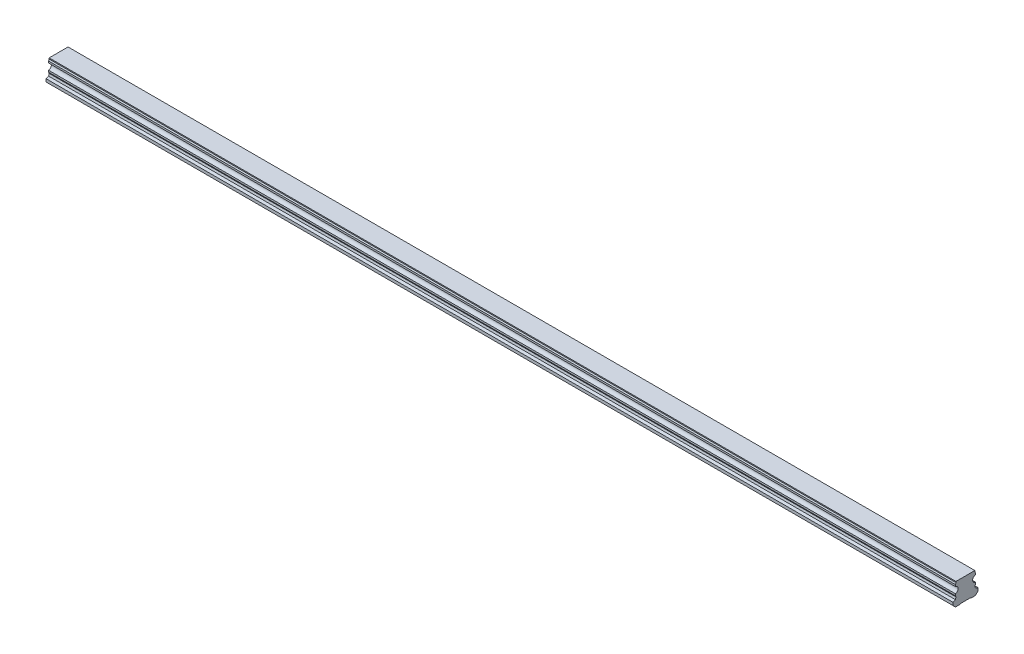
ISO-10303-21;
HEADER;
FILE_DESCRIPTION(('STEP AP214'),'2;1');
FILE_NAME('part.step','',(''),(''),'','','');
FILE_SCHEMA(('AUTOMOTIVE_DESIGN { 1 0 10303 214 1 1 1 1 }'));
ENDSEC;
DATA;
#1=APPLICATION_CONTEXT('core data for automotive mechanical design processes');
#2=APPLICATION_PROTOCOL_DEFINITION('international standard','automotive_design',2000,#1);
#3=PRODUCT_CONTEXT('',#1,'mechanical');
#4=PRODUCT('Part','Part','',(#3));
#5=PRODUCT_RELATED_PRODUCT_CATEGORY('part','',(#4));
#6=PRODUCT_DEFINITION_FORMATION('','',#4);
#7=PRODUCT_DEFINITION_CONTEXT('part definition',#1,'design');
#8=PRODUCT_DEFINITION('design','',#6,#7);
#9=PRODUCT_DEFINITION_SHAPE('','',#8);
#10=(LENGTH_UNIT() NAMED_UNIT(*) SI_UNIT(.MILLI.,.METRE.));
#11=(NAMED_UNIT(*) PLANE_ANGLE_UNIT() SI_UNIT($,.RADIAN.));
#12=(NAMED_UNIT(*) SI_UNIT($,.STERADIAN.) SOLID_ANGLE_UNIT());
#13=UNCERTAINTY_MEASURE_WITH_UNIT(LENGTH_MEASURE(1.E-05),#10,'distance_accuracy_value','');
#14=(GEOMETRIC_REPRESENTATION_CONTEXT(3) GLOBAL_UNCERTAINTY_ASSIGNED_CONTEXT((#13)) GLOBAL_UNIT_ASSIGNED_CONTEXT((#10,
#11,#12)) REPRESENTATION_CONTEXT('',''));
#15=CARTESIAN_POINT('',(0.,0.,0.));
#16=DIRECTION('',(0.,0.,1.));
#17=DIRECTION('',(1.,0.,0.));
#18=AXIS2_PLACEMENT_3D('',#15,#16,#17);
#19=CARTESIAN_POINT('',(870.,0.499999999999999,0.));
#20=DIRECTION('',(0.,-1.,0.));
#21=DIRECTION('',(0.,0.,-1.));
#22=AXIS2_PLACEMENT_3D('',#19,#20,#21);
#23=CONICAL_SURFACE('',#22,3.5,0.785398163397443);
#24=CARTESIAN_POINT('',(870.,1.00000000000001,0.));
#25=DIRECTION('',(0.,1.,0.));
#26=DIRECTION('',(0.,0.,1.));
#27=AXIS2_PLACEMENT_3D('',#24,#25,#26);
#28=CIRCLE('',#27,3.);
#29=CARTESIAN_POINT('',(870.,1.00000000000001,3.));
#30=VERTEX_POINT('',#29);
#31=EDGE_CURVE('E11',#30,#30,#28,.F.);
#32=ORIENTED_EDGE('',*,*,#31,.F.);
#33=EDGE_LOOP('',(#32));
#34=FACE_BOUND('',#33,.T.);
#35=CARTESIAN_POINT('',(870.,0.499999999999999,0.));
#36=DIRECTION('',(0.,1.,0.));
#37=DIRECTION('',(0.,0.,1.));
#38=AXIS2_PLACEMENT_3D('',#35,#36,#37);
#39=CIRCLE('',#38,3.5);
#40=CARTESIAN_POINT('',(870.,0.5,3.5));
#41=VERTEX_POINT('',#40);
#42=EDGE_CURVE('E578',#41,#41,#39,.T.);
#43=ORIENTED_EDGE('',*,*,#42,.F.);
#44=EDGE_LOOP('',(#43));
#45=FACE_BOUND('',#44,.T.);
#46=ADVANCED_FACE('F39',(#34,#45),#23,.F.);
#47=CARTESIAN_POINT('',(870.,12.,0.));
#48=DIRECTION('',(0.,-1.,0.));
#49=DIRECTION('',(0.,0.,-1.));
#50=AXIS2_PLACEMENT_3D('',#47,#48,#49);
#51=CYLINDRICAL_SURFACE('',#50,3.);
#52=ORIENTED_EDGE('',*,*,#31,.T.);
#53=EDGE_LOOP('',(#52));
#54=FACE_BOUND('',#53,.T.);
#55=CARTESIAN_POINT('',(870.,12.,0.));
#56=DIRECTION('',(0.,-1.,0.));
#57=DIRECTION('',(0.,0.,-1.));
#58=AXIS2_PLACEMENT_3D('',#55,#56,#57);
#59=CIRCLE('',#58,3.);
#60=CARTESIAN_POINT('',(870.,12.,-3.));
#61=VERTEX_POINT('',#60);
#62=EDGE_CURVE('E49',#61,#61,#59,.T.);
#63=ORIENTED_EDGE('',*,*,#62,.F.);
#64=EDGE_LOOP('',(#63));
#65=FACE_BOUND('',#64,.T.);
#66=ADVANCED_FACE('F760',(#54,#65),#51,.F.);
#67=CARTESIAN_POINT('',(870.,12.,0.));
#68=DIRECTION('',(0.,-1.,0.));
#69=DIRECTION('',(0.,0.,-1.));
#70=AXIS2_PLACEMENT_3D('',#67,#68,#69);
#71=PLANE('',#70);
#72=CARTESIAN_POINT('',(870.,12.,0.));
#73=DIRECTION('',(0.,-1.,0.));
#74=DIRECTION('',(0.,0.,-1.));
#75=AXIS2_PLACEMENT_3D('',#72,#73,#74);
#76=CIRCLE('',#75,2.5);
#77=CARTESIAN_POINT('',(870.,12.,-2.5));
#78=VERTEX_POINT('',#77);
#79=EDGE_CURVE('E42',#78,#78,#76,.T.);
#80=ORIENTED_EDGE('',*,*,#79,.F.);
#81=EDGE_LOOP('',(#80));
#82=FACE_BOUND('',#81,.T.);
#83=ORIENTED_EDGE('',*,*,#62,.T.);
#84=EDGE_LOOP('',(#83));
#85=FACE_BOUND('',#84,.T.);
#86=ADVANCED_FACE('F765',(#82,#85),#71,.T.);
#87=CARTESIAN_POINT('',(810.,0.499999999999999,0.));
#88=DIRECTION('',(0.,-1.,0.));
#89=DIRECTION('',(0.,0.,-1.));
#90=AXIS2_PLACEMENT_3D('',#87,#88,#89);
#91=CONICAL_SURFACE('',#90,3.5,0.785398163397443);
#92=CARTESIAN_POINT('',(810.,1.00000000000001,0.));
#93=DIRECTION('',(0.,1.,0.));
#94=DIRECTION('',(0.,0.,1.));
#95=AXIS2_PLACEMENT_3D('',#92,#93,#94);
#96=CIRCLE('',#95,3.);
#97=CARTESIAN_POINT('',(810.,1.00000000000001,3.));
#98=VERTEX_POINT('',#97);
#99=EDGE_CURVE('E574',#98,#98,#96,.F.);
#100=ORIENTED_EDGE('',*,*,#99,.F.);
#101=EDGE_LOOP('',(#100));
#102=FACE_BOUND('',#101,.T.);
#103=CARTESIAN_POINT('',(810.,0.499999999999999,0.));
#104=DIRECTION('',(0.,1.,0.));
#105=DIRECTION('',(0.,0.,1.));
#106=AXIS2_PLACEMENT_3D('',#103,#104,#105);
#107=CIRCLE('',#106,3.5);
#108=CARTESIAN_POINT('',(810.,0.5,3.5));
#109=VERTEX_POINT('',#108);
#110=EDGE_CURVE('E566',#109,#109,#107,.T.);
#111=ORIENTED_EDGE('',*,*,#110,.F.);
#112=EDGE_LOOP('',(#111));
#113=FACE_BOUND('',#112,.T.);
#114=ADVANCED_FACE('F984',(#102,#113),#91,.F.);
#115=CARTESIAN_POINT('',(810.,12.,0.));
#116=DIRECTION('',(0.,-1.,0.));
#117=DIRECTION('',(0.,0.,-1.));
#118=AXIS2_PLACEMENT_3D('',#115,#116,#117);
#119=CYLINDRICAL_SURFACE('',#118,3.);
#120=ORIENTED_EDGE('',*,*,#99,.T.);
#121=EDGE_LOOP('',(#120));
#122=FACE_BOUND('',#121,.T.);
#123=CARTESIAN_POINT('',(810.,12.,0.));
#124=DIRECTION('',(0.,-1.,0.));
#125=DIRECTION('',(0.,0.,-1.));
#126=AXIS2_PLACEMENT_3D('',#123,#124,#125);
#127=CIRCLE('',#126,3.);
#128=CARTESIAN_POINT('',(810.,12.,-3.));
#129=VERTEX_POINT('',#128);
#130=EDGE_CURVE('E570',#129,#129,#127,.T.);
#131=ORIENTED_EDGE('',*,*,#130,.F.);
#132=EDGE_LOOP('',(#131));
#133=FACE_BOUND('',#132,.T.);
#134=ADVANCED_FACE('F980',(#122,#133),#119,.F.);
#135=CARTESIAN_POINT('',(810.,12.,0.));
#136=DIRECTION('',(0.,-1.,0.));
#137=DIRECTION('',(0.,0.,-1.));
#138=AXIS2_PLACEMENT_3D('',#135,#136,#137);
#139=PLANE('',#138);
#140=CARTESIAN_POINT('',(810.,12.,0.));
#141=DIRECTION('',(0.,-1.,0.));
#142=DIRECTION('',(0.,0.,-1.));
#143=AXIS2_PLACEMENT_3D('',#140,#141,#142);
#144=CIRCLE('',#143,2.5);
#145=CARTESIAN_POINT('',(810.,12.,-2.5));
#146=VERTEX_POINT('',#145);
#147=EDGE_CURVE('E633',#146,#146,#144,.T.);
#148=ORIENTED_EDGE('',*,*,#147,.F.);
#149=EDGE_LOOP('',(#148));
#150=FACE_BOUND('',#149,.T.);
#151=ORIENTED_EDGE('',*,*,#130,.T.);
#152=EDGE_LOOP('',(#151));
#153=FACE_BOUND('',#152,.T.);
#154=ADVANCED_FACE('F976',(#150,#153),#139,.T.);
#155=CARTESIAN_POINT('',(750.,0.499999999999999,0.));
#156=DIRECTION('',(0.,-1.,0.));
#157=DIRECTION('',(0.,0.,-1.));
#158=AXIS2_PLACEMENT_3D('',#155,#156,#157);
#159=CONICAL_SURFACE('',#158,3.5,0.785398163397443);
#160=CARTESIAN_POINT('',(750.,1.00000000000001,0.));
#161=DIRECTION('',(0.,1.,0.));
#162=DIRECTION('',(0.,0.,1.));
#163=AXIS2_PLACEMENT_3D('',#160,#161,#162);
#164=CIRCLE('',#163,3.);
#165=CARTESIAN_POINT('',(750.,1.00000000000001,3.));
#166=VERTEX_POINT('',#165);
#167=EDGE_CURVE('E562',#166,#166,#164,.F.);
#168=ORIENTED_EDGE('',*,*,#167,.F.);
#169=EDGE_LOOP('',(#168));
#170=FACE_BOUND('',#169,.T.);
#171=CARTESIAN_POINT('',(750.,0.499999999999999,0.));
#172=DIRECTION('',(0.,1.,0.));
#173=DIRECTION('',(0.,0.,1.));
#174=AXIS2_PLACEMENT_3D('',#171,#172,#173);
#175=CIRCLE('',#174,3.5);
#176=CARTESIAN_POINT('',(750.,0.5,3.5));
#177=VERTEX_POINT('',#176);
#178=EDGE_CURVE('E554',#177,#177,#175,.T.);
#179=ORIENTED_EDGE('',*,*,#178,.F.);
#180=EDGE_LOOP('',(#179));
#181=FACE_BOUND('',#180,.T.);
#182=ADVANCED_FACE('F972',(#170,#181),#159,.F.);
#183=CARTESIAN_POINT('',(750.,12.,0.));
#184=DIRECTION('',(0.,-1.,0.));
#185=DIRECTION('',(0.,0.,-1.));
#186=AXIS2_PLACEMENT_3D('',#183,#184,#185);
#187=CYLINDRICAL_SURFACE('',#186,3.);
#188=ORIENTED_EDGE('',*,*,#167,.T.);
#189=EDGE_LOOP('',(#188));
#190=FACE_BOUND('',#189,.T.);
#191=CARTESIAN_POINT('',(750.,12.,0.));
#192=DIRECTION('',(0.,-1.,0.));
#193=DIRECTION('',(0.,0.,-1.));
#194=AXIS2_PLACEMENT_3D('',#191,#192,#193);
#195=CIRCLE('',#194,3.);
#196=CARTESIAN_POINT('',(750.,12.,-3.));
#197=VERTEX_POINT('',#196);
#198=EDGE_CURVE('E558',#197,#197,#195,.T.);
#199=ORIENTED_EDGE('',*,*,#198,.F.);
#200=EDGE_LOOP('',(#199));
#201=FACE_BOUND('',#200,.T.);
#202=ADVANCED_FACE('F968',(#190,#201),#187,.F.);
#203=CARTESIAN_POINT('',(750.,12.,0.));
#204=DIRECTION('',(0.,-1.,0.));
#205=DIRECTION('',(0.,0.,-1.));
#206=AXIS2_PLACEMENT_3D('',#203,#204,#205);
#207=PLANE('',#206);
#208=CARTESIAN_POINT('',(750.,12.,0.));
#209=DIRECTION('',(0.,-1.,0.));
#210=DIRECTION('',(0.,0.,-1.));
#211=AXIS2_PLACEMENT_3D('',#208,#209,#210);
#212=CIRCLE('',#211,2.5);
#213=CARTESIAN_POINT('',(750.,12.,-2.5));
#214=VERTEX_POINT('',#213);
#215=EDGE_CURVE('E630',#214,#214,#212,.T.);
#216=ORIENTED_EDGE('',*,*,#215,.F.);
#217=EDGE_LOOP('',(#216));
#218=FACE_BOUND('',#217,.T.);
#219=ORIENTED_EDGE('',*,*,#198,.T.);
#220=EDGE_LOOP('',(#219));
#221=FACE_BOUND('',#220,.T.);
#222=ADVANCED_FACE('F964',(#218,#221),#207,.T.);
#223=CARTESIAN_POINT('',(690.,0.499999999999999,0.));
#224=DIRECTION('',(0.,-1.,0.));
#225=DIRECTION('',(0.,0.,-1.));
#226=AXIS2_PLACEMENT_3D('',#223,#224,#225);
#227=CONICAL_SURFACE('',#226,3.5,0.785398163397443);
#228=CARTESIAN_POINT('',(690.,1.00000000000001,0.));
#229=DIRECTION('',(0.,1.,0.));
#230=DIRECTION('',(0.,0.,1.));
#231=AXIS2_PLACEMENT_3D('',#228,#229,#230);
#232=CIRCLE('',#231,3.);
#233=CARTESIAN_POINT('',(690.,1.00000000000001,3.));
#234=VERTEX_POINT('',#233);
#235=EDGE_CURVE('E550',#234,#234,#232,.F.);
#236=ORIENTED_EDGE('',*,*,#235,.F.);
#237=EDGE_LOOP('',(#236));
#238=FACE_BOUND('',#237,.T.);
#239=CARTESIAN_POINT('',(690.,0.499999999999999,0.));
#240=DIRECTION('',(0.,1.,0.));
#241=DIRECTION('',(0.,0.,1.));
#242=AXIS2_PLACEMENT_3D('',#239,#240,#241);
#243=CIRCLE('',#242,3.5);
#244=CARTESIAN_POINT('',(690.,0.5,3.5));
#245=VERTEX_POINT('',#244);
#246=EDGE_CURVE('E542',#245,#245,#243,.T.);
#247=ORIENTED_EDGE('',*,*,#246,.F.);
#248=EDGE_LOOP('',(#247));
#249=FACE_BOUND('',#248,.T.);
#250=ADVANCED_FACE('F960',(#238,#249),#227,.F.);
#251=CARTESIAN_POINT('',(690.,12.,0.));
#252=DIRECTION('',(0.,-1.,0.));
#253=DIRECTION('',(0.,0.,-1.));
#254=AXIS2_PLACEMENT_3D('',#251,#252,#253);
#255=CYLINDRICAL_SURFACE('',#254,3.);
#256=ORIENTED_EDGE('',*,*,#235,.T.);
#257=EDGE_LOOP('',(#256));
#258=FACE_BOUND('',#257,.T.);
#259=CARTESIAN_POINT('',(690.,12.,0.));
#260=DIRECTION('',(0.,-1.,0.));
#261=DIRECTION('',(0.,0.,-1.));
#262=AXIS2_PLACEMENT_3D('',#259,#260,#261);
#263=CIRCLE('',#262,3.);
#264=CARTESIAN_POINT('',(690.,12.,-3.));
#265=VERTEX_POINT('',#264);
#266=EDGE_CURVE('E546',#265,#265,#263,.T.);
#267=ORIENTED_EDGE('',*,*,#266,.F.);
#268=EDGE_LOOP('',(#267));
#269=FACE_BOUND('',#268,.T.);
#270=ADVANCED_FACE('F956',(#258,#269),#255,.F.);
#271=CARTESIAN_POINT('',(690.,12.,0.));
#272=DIRECTION('',(0.,-1.,0.));
#273=DIRECTION('',(0.,0.,-1.));
#274=AXIS2_PLACEMENT_3D('',#271,#272,#273);
#275=PLANE('',#274);
#276=CARTESIAN_POINT('',(690.,12.,0.));
#277=DIRECTION('',(0.,-1.,0.));
#278=DIRECTION('',(0.,0.,-1.));
#279=AXIS2_PLACEMENT_3D('',#276,#277,#278);
#280=CIRCLE('',#279,2.5);
#281=CARTESIAN_POINT('',(690.,12.,-2.5));
#282=VERTEX_POINT('',#281);
#283=EDGE_CURVE('E626',#282,#282,#280,.T.);
#284=ORIENTED_EDGE('',*,*,#283,.F.);
#285=EDGE_LOOP('',(#284));
#286=FACE_BOUND('',#285,.T.);
#287=ORIENTED_EDGE('',*,*,#266,.T.);
#288=EDGE_LOOP('',(#287));
#289=FACE_BOUND('',#288,.T.);
#290=ADVANCED_FACE('F952',(#286,#289),#275,.T.);
#291=CARTESIAN_POINT('',(630.,0.499999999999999,0.));
#292=DIRECTION('',(0.,-1.,0.));
#293=DIRECTION('',(0.,0.,-1.));
#294=AXIS2_PLACEMENT_3D('',#291,#292,#293);
#295=CONICAL_SURFACE('',#294,3.5,0.785398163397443);
#296=CARTESIAN_POINT('',(630.,1.00000000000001,0.));
#297=DIRECTION('',(0.,1.,0.));
#298=DIRECTION('',(0.,0.,1.));
#299=AXIS2_PLACEMENT_3D('',#296,#297,#298);
#300=CIRCLE('',#299,3.);
#301=CARTESIAN_POINT('',(630.,1.00000000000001,3.));
#302=VERTEX_POINT('',#301);
#303=EDGE_CURVE('E538',#302,#302,#300,.F.);
#304=ORIENTED_EDGE('',*,*,#303,.F.);
#305=EDGE_LOOP('',(#304));
#306=FACE_BOUND('',#305,.T.);
#307=CARTESIAN_POINT('',(630.,0.499999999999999,0.));
#308=DIRECTION('',(0.,1.,0.));
#309=DIRECTION('',(0.,0.,1.));
#310=AXIS2_PLACEMENT_3D('',#307,#308,#309);
#311=CIRCLE('',#310,3.5);
#312=CARTESIAN_POINT('',(630.,0.5,3.5));
#313=VERTEX_POINT('',#312);
#314=EDGE_CURVE('E530',#313,#313,#311,.T.);
#315=ORIENTED_EDGE('',*,*,#314,.F.);
#316=EDGE_LOOP('',(#315));
#317=FACE_BOUND('',#316,.T.);
#318=ADVANCED_FACE('F948',(#306,#317),#295,.F.);
#319=CARTESIAN_POINT('',(630.,12.,0.));
#320=DIRECTION('',(0.,-1.,0.));
#321=DIRECTION('',(0.,0.,-1.));
#322=AXIS2_PLACEMENT_3D('',#319,#320,#321);
#323=CYLINDRICAL_SURFACE('',#322,3.);
#324=ORIENTED_EDGE('',*,*,#303,.T.);
#325=EDGE_LOOP('',(#324));
#326=FACE_BOUND('',#325,.T.);
#327=CARTESIAN_POINT('',(630.,12.,0.));
#328=DIRECTION('',(0.,-1.,0.));
#329=DIRECTION('',(0.,0.,-1.));
#330=AXIS2_PLACEMENT_3D('',#327,#328,#329);
#331=CIRCLE('',#330,3.);
#332=CARTESIAN_POINT('',(630.,12.,-3.));
#333=VERTEX_POINT('',#332);
#334=EDGE_CURVE('E534',#333,#333,#331,.T.);
#335=ORIENTED_EDGE('',*,*,#334,.F.);
#336=EDGE_LOOP('',(#335));
#337=FACE_BOUND('',#336,.T.);
#338=ADVANCED_FACE('F944',(#326,#337),#323,.F.);
#339=CARTESIAN_POINT('',(630.,12.,0.));
#340=DIRECTION('',(0.,-1.,0.));
#341=DIRECTION('',(0.,0.,-1.));
#342=AXIS2_PLACEMENT_3D('',#339,#340,#341);
#343=PLANE('',#342);
#344=CARTESIAN_POINT('',(630.,12.,0.));
#345=DIRECTION('',(0.,-1.,0.));
#346=DIRECTION('',(0.,0.,-1.));
#347=AXIS2_PLACEMENT_3D('',#344,#345,#346);
#348=CIRCLE('',#347,2.5);
#349=CARTESIAN_POINT('',(630.,12.,-2.5));
#350=VERTEX_POINT('',#349);
#351=EDGE_CURVE('E622',#350,#350,#348,.T.);
#352=ORIENTED_EDGE('',*,*,#351,.F.);
#353=EDGE_LOOP('',(#352));
#354=FACE_BOUND('',#353,.T.);
#355=ORIENTED_EDGE('',*,*,#334,.T.);
#356=EDGE_LOOP('',(#355));
#357=FACE_BOUND('',#356,.T.);
#358=ADVANCED_FACE('F940',(#354,#357),#343,.T.);
#359=CARTESIAN_POINT('',(570.,0.499999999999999,0.));
#360=DIRECTION('',(0.,-1.,0.));
#361=DIRECTION('',(0.,0.,-1.));
#362=AXIS2_PLACEMENT_3D('',#359,#360,#361);
#363=CONICAL_SURFACE('',#362,3.5,0.785398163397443);
#364=CARTESIAN_POINT('',(570.,1.00000000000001,0.));
#365=DIRECTION('',(0.,1.,0.));
#366=DIRECTION('',(0.,0.,1.));
#367=AXIS2_PLACEMENT_3D('',#364,#365,#366);
#368=CIRCLE('',#367,3.);
#369=CARTESIAN_POINT('',(570.,1.00000000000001,3.));
#370=VERTEX_POINT('',#369);
#371=EDGE_CURVE('E526',#370,#370,#368,.F.);
#372=ORIENTED_EDGE('',*,*,#371,.F.);
#373=EDGE_LOOP('',(#372));
#374=FACE_BOUND('',#373,.T.);
#375=CARTESIAN_POINT('',(570.,0.499999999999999,0.));
#376=DIRECTION('',(0.,1.,0.));
#377=DIRECTION('',(0.,0.,1.));
#378=AXIS2_PLACEMENT_3D('',#375,#376,#377);
#379=CIRCLE('',#378,3.5);
#380=CARTESIAN_POINT('',(570.,0.5,3.5));
#381=VERTEX_POINT('',#380);
#382=EDGE_CURVE('E518',#381,#381,#379,.T.);
#383=ORIENTED_EDGE('',*,*,#382,.F.);
#384=EDGE_LOOP('',(#383));
#385=FACE_BOUND('',#384,.T.);
#386=ADVANCED_FACE('F936',(#374,#385),#363,.F.);
#387=CARTESIAN_POINT('',(570.,12.,0.));
#388=DIRECTION('',(0.,-1.,0.));
#389=DIRECTION('',(0.,0.,-1.));
#390=AXIS2_PLACEMENT_3D('',#387,#388,#389);
#391=CYLINDRICAL_SURFACE('',#390,3.);
#392=ORIENTED_EDGE('',*,*,#371,.T.);
#393=EDGE_LOOP('',(#392));
#394=FACE_BOUND('',#393,.T.);
#395=CARTESIAN_POINT('',(570.,12.,0.));
#396=DIRECTION('',(0.,-1.,0.));
#397=DIRECTION('',(0.,0.,-1.));
#398=AXIS2_PLACEMENT_3D('',#395,#396,#397);
#399=CIRCLE('',#398,3.);
#400=CARTESIAN_POINT('',(570.,12.,-3.));
#401=VERTEX_POINT('',#400);
#402=EDGE_CURVE('E522',#401,#401,#399,.T.);
#403=ORIENTED_EDGE('',*,*,#402,.F.);
#404=EDGE_LOOP('',(#403));
#405=FACE_BOUND('',#404,.T.);
#406=ADVANCED_FACE('F932',(#394,#405),#391,.F.);
#407=CARTESIAN_POINT('',(570.,12.,0.));
#408=DIRECTION('',(0.,-1.,0.));
#409=DIRECTION('',(0.,0.,-1.));
#410=AXIS2_PLACEMENT_3D('',#407,#408,#409);
#411=PLANE('',#410);
#412=CARTESIAN_POINT('',(570.,12.,0.));
#413=DIRECTION('',(0.,-1.,0.));
#414=DIRECTION('',(0.,0.,-1.));
#415=AXIS2_PLACEMENT_3D('',#412,#413,#414);
#416=CIRCLE('',#415,2.5);
#417=CARTESIAN_POINT('',(570.,12.,-2.5));
#418=VERTEX_POINT('',#417);
#419=EDGE_CURVE('E618',#418,#418,#416,.T.);
#420=ORIENTED_EDGE('',*,*,#419,.F.);
#421=EDGE_LOOP('',(#420));
#422=FACE_BOUND('',#421,.T.);
#423=ORIENTED_EDGE('',*,*,#402,.T.);
#424=EDGE_LOOP('',(#423));
#425=FACE_BOUND('',#424,.T.);
#426=ADVANCED_FACE('F928',(#422,#425),#411,.T.);
#427=CARTESIAN_POINT('',(510.,0.499999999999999,0.));
#428=DIRECTION('',(0.,-1.,0.));
#429=DIRECTION('',(0.,0.,-1.));
#430=AXIS2_PLACEMENT_3D('',#427,#428,#429);
#431=CONICAL_SURFACE('',#430,3.5,0.785398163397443);
#432=CARTESIAN_POINT('',(510.,1.00000000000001,0.));
#433=DIRECTION('',(0.,1.,0.));
#434=DIRECTION('',(0.,0.,1.));
#435=AXIS2_PLACEMENT_3D('',#432,#433,#434);
#436=CIRCLE('',#435,3.);
#437=CARTESIAN_POINT('',(510.,1.00000000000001,3.));
#438=VERTEX_POINT('',#437);
#439=EDGE_CURVE('E514',#438,#438,#436,.F.);
#440=ORIENTED_EDGE('',*,*,#439,.F.);
#441=EDGE_LOOP('',(#440));
#442=FACE_BOUND('',#441,.T.);
#443=CARTESIAN_POINT('',(510.,0.499999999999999,0.));
#444=DIRECTION('',(0.,1.,0.));
#445=DIRECTION('',(0.,0.,1.));
#446=AXIS2_PLACEMENT_3D('',#443,#444,#445);
#447=CIRCLE('',#446,3.5);
#448=CARTESIAN_POINT('',(510.,0.5,3.5));
#449=VERTEX_POINT('',#448);
#450=EDGE_CURVE('E506',#449,#449,#447,.T.);
#451=ORIENTED_EDGE('',*,*,#450,.F.);
#452=EDGE_LOOP('',(#451));
#453=FACE_BOUND('',#452,.T.);
#454=ADVANCED_FACE('F924',(#442,#453),#431,.F.);
#455=CARTESIAN_POINT('',(510.,12.,0.));
#456=DIRECTION('',(0.,-1.,0.));
#457=DIRECTION('',(0.,0.,-1.));
#458=AXIS2_PLACEMENT_3D('',#455,#456,#457);
#459=CYLINDRICAL_SURFACE('',#458,3.);
#460=ORIENTED_EDGE('',*,*,#439,.T.);
#461=EDGE_LOOP('',(#460));
#462=FACE_BOUND('',#461,.T.);
#463=CARTESIAN_POINT('',(510.,12.,0.));
#464=DIRECTION('',(0.,-1.,0.));
#465=DIRECTION('',(0.,0.,-1.));
#466=AXIS2_PLACEMENT_3D('',#463,#464,#465);
#467=CIRCLE('',#466,3.);
#468=CARTESIAN_POINT('',(510.,12.,-3.));
#469=VERTEX_POINT('',#468);
#470=EDGE_CURVE('E510',#469,#469,#467,.T.);
#471=ORIENTED_EDGE('',*,*,#470,.F.);
#472=EDGE_LOOP('',(#471));
#473=FACE_BOUND('',#472,.T.);
#474=ADVANCED_FACE('F920',(#462,#473),#459,.F.);
#475=CARTESIAN_POINT('',(510.,12.,0.));
#476=DIRECTION('',(0.,-1.,0.));
#477=DIRECTION('',(0.,0.,-1.));
#478=AXIS2_PLACEMENT_3D('',#475,#476,#477);
#479=PLANE('',#478);
#480=CARTESIAN_POINT('',(510.,12.,0.));
#481=DIRECTION('',(0.,-1.,0.));
#482=DIRECTION('',(0.,0.,-1.));
#483=AXIS2_PLACEMENT_3D('',#480,#481,#482);
#484=CIRCLE('',#483,2.5);
#485=CARTESIAN_POINT('',(510.,12.,-2.5));
#486=VERTEX_POINT('',#485);
#487=EDGE_CURVE('E614',#486,#486,#484,.T.);
#488=ORIENTED_EDGE('',*,*,#487,.F.);
#489=EDGE_LOOP('',(#488));
#490=FACE_BOUND('',#489,.T.);
#491=ORIENTED_EDGE('',*,*,#470,.T.);
#492=EDGE_LOOP('',(#491));
#493=FACE_BOUND('',#492,.T.);
#494=ADVANCED_FACE('F916',(#490,#493),#479,.T.);
#495=CARTESIAN_POINT('',(450.,0.499999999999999,0.));
#496=DIRECTION('',(0.,-1.,0.));
#497=DIRECTION('',(0.,0.,-1.));
#498=AXIS2_PLACEMENT_3D('',#495,#496,#497);
#499=CONICAL_SURFACE('',#498,3.5,0.785398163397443);
#500=CARTESIAN_POINT('',(450.,1.00000000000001,0.));
#501=DIRECTION('',(0.,1.,0.));
#502=DIRECTION('',(0.,0.,1.));
#503=AXIS2_PLACEMENT_3D('',#500,#501,#502);
#504=CIRCLE('',#503,3.);
#505=CARTESIAN_POINT('',(450.,1.00000000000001,3.));
#506=VERTEX_POINT('',#505);
#507=EDGE_CURVE('E502',#506,#506,#504,.F.);
#508=ORIENTED_EDGE('',*,*,#507,.F.);
#509=EDGE_LOOP('',(#508));
#510=FACE_BOUND('',#509,.T.);
#511=CARTESIAN_POINT('',(450.,0.499999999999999,0.));
#512=DIRECTION('',(0.,1.,0.));
#513=DIRECTION('',(0.,0.,1.));
#514=AXIS2_PLACEMENT_3D('',#511,#512,#513);
#515=CIRCLE('',#514,3.5);
#516=CARTESIAN_POINT('',(450.,0.5,3.5));
#517=VERTEX_POINT('',#516);
#518=EDGE_CURVE('E494',#517,#517,#515,.T.);
#519=ORIENTED_EDGE('',*,*,#518,.F.);
#520=EDGE_LOOP('',(#519));
#521=FACE_BOUND('',#520,.T.);
#522=ADVANCED_FACE('F912',(#510,#521),#499,.F.);
#523=CARTESIAN_POINT('',(450.,12.,0.));
#524=DIRECTION('',(0.,-1.,0.));
#525=DIRECTION('',(0.,0.,-1.));
#526=AXIS2_PLACEMENT_3D('',#523,#524,#525);
#527=CYLINDRICAL_SURFACE('',#526,3.);
#528=ORIENTED_EDGE('',*,*,#507,.T.);
#529=EDGE_LOOP('',(#528));
#530=FACE_BOUND('',#529,.T.);
#531=CARTESIAN_POINT('',(450.,12.,0.));
#532=DIRECTION('',(0.,-1.,0.));
#533=DIRECTION('',(0.,0.,-1.));
#534=AXIS2_PLACEMENT_3D('',#531,#532,#533);
#535=CIRCLE('',#534,3.);
#536=CARTESIAN_POINT('',(450.,12.,-3.));
#537=VERTEX_POINT('',#536);
#538=EDGE_CURVE('E498',#537,#537,#535,.T.);
#539=ORIENTED_EDGE('',*,*,#538,.F.);
#540=EDGE_LOOP('',(#539));
#541=FACE_BOUND('',#540,.T.);
#542=ADVANCED_FACE('F908',(#530,#541),#527,.F.);
#543=CARTESIAN_POINT('',(450.,12.,0.));
#544=DIRECTION('',(0.,-1.,0.));
#545=DIRECTION('',(0.,0.,-1.));
#546=AXIS2_PLACEMENT_3D('',#543,#544,#545);
#547=PLANE('',#546);
#548=CARTESIAN_POINT('',(450.,12.,0.));
#549=DIRECTION('',(0.,-1.,0.));
#550=DIRECTION('',(0.,0.,-1.));
#551=AXIS2_PLACEMENT_3D('',#548,#549,#550);
#552=CIRCLE('',#551,2.5);
#553=CARTESIAN_POINT('',(450.,12.,-2.5));
#554=VERTEX_POINT('',#553);
#555=EDGE_CURVE('E610',#554,#554,#552,.T.);
#556=ORIENTED_EDGE('',*,*,#555,.F.);
#557=EDGE_LOOP('',(#556));
#558=FACE_BOUND('',#557,.T.);
#559=ORIENTED_EDGE('',*,*,#538,.T.);
#560=EDGE_LOOP('',(#559));
#561=FACE_BOUND('',#560,.T.);
#562=ADVANCED_FACE('F904',(#558,#561),#547,.T.);
#563=CARTESIAN_POINT('',(390.,0.499999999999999,0.));
#564=DIRECTION('',(0.,-1.,0.));
#565=DIRECTION('',(0.,0.,-1.));
#566=AXIS2_PLACEMENT_3D('',#563,#564,#565);
#567=CONICAL_SURFACE('',#566,3.5,0.785398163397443);
#568=CARTESIAN_POINT('',(390.,1.00000000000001,0.));
#569=DIRECTION('',(0.,1.,0.));
#570=DIRECTION('',(0.,0.,1.));
#571=AXIS2_PLACEMENT_3D('',#568,#569,#570);
#572=CIRCLE('',#571,3.);
#573=CARTESIAN_POINT('',(390.,1.00000000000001,3.));
#574=VERTEX_POINT('',#573);
#575=EDGE_CURVE('E490',#574,#574,#572,.F.);
#576=ORIENTED_EDGE('',*,*,#575,.F.);
#577=EDGE_LOOP('',(#576));
#578=FACE_BOUND('',#577,.T.);
#579=CARTESIAN_POINT('',(390.,0.499999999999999,0.));
#580=DIRECTION('',(0.,1.,0.));
#581=DIRECTION('',(0.,0.,1.));
#582=AXIS2_PLACEMENT_3D('',#579,#580,#581);
#583=CIRCLE('',#582,3.5);
#584=CARTESIAN_POINT('',(390.,0.5,3.5));
#585=VERTEX_POINT('',#584);
#586=EDGE_CURVE('E482',#585,#585,#583,.T.);
#587=ORIENTED_EDGE('',*,*,#586,.F.);
#588=EDGE_LOOP('',(#587));
#589=FACE_BOUND('',#588,.T.);
#590=ADVANCED_FACE('F900',(#578,#589),#567,.F.);
#591=CARTESIAN_POINT('',(390.,12.,0.));
#592=DIRECTION('',(0.,-1.,0.));
#593=DIRECTION('',(0.,0.,-1.));
#594=AXIS2_PLACEMENT_3D('',#591,#592,#593);
#595=CYLINDRICAL_SURFACE('',#594,3.);
#596=ORIENTED_EDGE('',*,*,#575,.T.);
#597=EDGE_LOOP('',(#596));
#598=FACE_BOUND('',#597,.T.);
#599=CARTESIAN_POINT('',(390.,12.,0.));
#600=DIRECTION('',(0.,-1.,0.));
#601=DIRECTION('',(0.,0.,-1.));
#602=AXIS2_PLACEMENT_3D('',#599,#600,#601);
#603=CIRCLE('',#602,3.);
#604=CARTESIAN_POINT('',(390.,12.,-3.));
#605=VERTEX_POINT('',#604);
#606=EDGE_CURVE('E486',#605,#605,#603,.T.);
#607=ORIENTED_EDGE('',*,*,#606,.F.);
#608=EDGE_LOOP('',(#607));
#609=FACE_BOUND('',#608,.T.);
#610=ADVANCED_FACE('F896',(#598,#609),#595,.F.);
#611=CARTESIAN_POINT('',(390.,12.,0.));
#612=DIRECTION('',(0.,-1.,0.));
#613=DIRECTION('',(0.,0.,-1.));
#614=AXIS2_PLACEMENT_3D('',#611,#612,#613);
#615=PLANE('',#614);
#616=CARTESIAN_POINT('',(390.,12.,0.));
#617=DIRECTION('',(0.,-1.,0.));
#618=DIRECTION('',(0.,0.,-1.));
#619=AXIS2_PLACEMENT_3D('',#616,#617,#618);
#620=CIRCLE('',#619,2.5);
#621=CARTESIAN_POINT('',(390.,12.,-2.5));
#622=VERTEX_POINT('',#621);
#623=EDGE_CURVE('E606',#622,#622,#620,.T.);
#624=ORIENTED_EDGE('',*,*,#623,.F.);
#625=EDGE_LOOP('',(#624));
#626=FACE_BOUND('',#625,.T.);
#627=ORIENTED_EDGE('',*,*,#606,.T.);
#628=EDGE_LOOP('',(#627));
#629=FACE_BOUND('',#628,.T.);
#630=ADVANCED_FACE('F892',(#626,#629),#615,.T.);
#631=CARTESIAN_POINT('',(330.,0.499999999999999,0.));
#632=DIRECTION('',(0.,-1.,0.));
#633=DIRECTION('',(0.,0.,-1.));
#634=AXIS2_PLACEMENT_3D('',#631,#632,#633);
#635=CONICAL_SURFACE('',#634,3.5,0.785398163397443);
#636=CARTESIAN_POINT('',(330.,1.00000000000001,0.));
#637=DIRECTION('',(0.,1.,0.));
#638=DIRECTION('',(0.,0.,1.));
#639=AXIS2_PLACEMENT_3D('',#636,#637,#638);
#640=CIRCLE('',#639,3.);
#641=CARTESIAN_POINT('',(330.,1.00000000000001,3.));
#642=VERTEX_POINT('',#641);
#643=EDGE_CURVE('E478',#642,#642,#640,.F.);
#644=ORIENTED_EDGE('',*,*,#643,.F.);
#645=EDGE_LOOP('',(#644));
#646=FACE_BOUND('',#645,.T.);
#647=CARTESIAN_POINT('',(330.,0.499999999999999,0.));
#648=DIRECTION('',(0.,1.,0.));
#649=DIRECTION('',(0.,0.,1.));
#650=AXIS2_PLACEMENT_3D('',#647,#648,#649);
#651=CIRCLE('',#650,3.5);
#652=CARTESIAN_POINT('',(330.,0.5,3.5));
#653=VERTEX_POINT('',#652);
#654=EDGE_CURVE('E470',#653,#653,#651,.T.);
#655=ORIENTED_EDGE('',*,*,#654,.F.);
#656=EDGE_LOOP('',(#655));
#657=FACE_BOUND('',#656,.T.);
#658=ADVANCED_FACE('F888',(#646,#657),#635,.F.);
#659=CARTESIAN_POINT('',(330.,12.,0.));
#660=DIRECTION('',(0.,-1.,0.));
#661=DIRECTION('',(0.,0.,-1.));
#662=AXIS2_PLACEMENT_3D('',#659,#660,#661);
#663=CYLINDRICAL_SURFACE('',#662,3.);
#664=ORIENTED_EDGE('',*,*,#643,.T.);
#665=EDGE_LOOP('',(#664));
#666=FACE_BOUND('',#665,.T.);
#667=CARTESIAN_POINT('',(330.,12.,0.));
#668=DIRECTION('',(0.,-1.,0.));
#669=DIRECTION('',(0.,0.,-1.));
#670=AXIS2_PLACEMENT_3D('',#667,#668,#669);
#671=CIRCLE('',#670,3.);
#672=CARTESIAN_POINT('',(330.,12.,-3.));
#673=VERTEX_POINT('',#672);
#674=EDGE_CURVE('E474',#673,#673,#671,.T.);
#675=ORIENTED_EDGE('',*,*,#674,.F.);
#676=EDGE_LOOP('',(#675));
#677=FACE_BOUND('',#676,.T.);
#678=ADVANCED_FACE('F884',(#666,#677),#663,.F.);
#679=CARTESIAN_POINT('',(330.,12.,0.));
#680=DIRECTION('',(0.,-1.,0.));
#681=DIRECTION('',(0.,0.,-1.));
#682=AXIS2_PLACEMENT_3D('',#679,#680,#681);
#683=PLANE('',#682);
#684=CARTESIAN_POINT('',(330.,12.,0.));
#685=DIRECTION('',(0.,-1.,0.));
#686=DIRECTION('',(0.,0.,-1.));
#687=AXIS2_PLACEMENT_3D('',#684,#685,#686);
#688=CIRCLE('',#687,2.5);
#689=CARTESIAN_POINT('',(330.,12.,-2.5));
#690=VERTEX_POINT('',#689);
#691=EDGE_CURVE('E602',#690,#690,#688,.T.);
#692=ORIENTED_EDGE('',*,*,#691,.F.);
#693=EDGE_LOOP('',(#692));
#694=FACE_BOUND('',#693,.T.);
#695=ORIENTED_EDGE('',*,*,#674,.T.);
#696=EDGE_LOOP('',(#695));
#697=FACE_BOUND('',#696,.T.);
#698=ADVANCED_FACE('F880',(#694,#697),#683,.T.);
#699=CARTESIAN_POINT('',(270.,0.499999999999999,0.));
#700=DIRECTION('',(0.,-1.,0.));
#701=DIRECTION('',(0.,0.,-1.));
#702=AXIS2_PLACEMENT_3D('',#699,#700,#701);
#703=CONICAL_SURFACE('',#702,3.5,0.785398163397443);
#704=CARTESIAN_POINT('',(270.,1.00000000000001,0.));
#705=DIRECTION('',(0.,1.,0.));
#706=DIRECTION('',(0.,0.,1.));
#707=AXIS2_PLACEMENT_3D('',#704,#705,#706);
#708=CIRCLE('',#707,3.);
#709=CARTESIAN_POINT('',(270.,1.00000000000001,3.));
#710=VERTEX_POINT('',#709);
#711=EDGE_CURVE('E466',#710,#710,#708,.F.);
#712=ORIENTED_EDGE('',*,*,#711,.F.);
#713=EDGE_LOOP('',(#712));
#714=FACE_BOUND('',#713,.T.);
#715=CARTESIAN_POINT('',(270.,0.499999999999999,0.));
#716=DIRECTION('',(0.,1.,0.));
#717=DIRECTION('',(0.,0.,1.));
#718=AXIS2_PLACEMENT_3D('',#715,#716,#717);
#719=CIRCLE('',#718,3.5);
#720=CARTESIAN_POINT('',(270.,0.5,3.5));
#721=VERTEX_POINT('',#720);
#722=EDGE_CURVE('E458',#721,#721,#719,.T.);
#723=ORIENTED_EDGE('',*,*,#722,.F.);
#724=EDGE_LOOP('',(#723));
#725=FACE_BOUND('',#724,.T.);
#726=ADVANCED_FACE('F876',(#714,#725),#703,.F.);
#727=CARTESIAN_POINT('',(270.,12.,0.));
#728=DIRECTION('',(0.,-1.,0.));
#729=DIRECTION('',(0.,0.,-1.));
#730=AXIS2_PLACEMENT_3D('',#727,#728,#729);
#731=CYLINDRICAL_SURFACE('',#730,3.);
#732=ORIENTED_EDGE('',*,*,#711,.T.);
#733=EDGE_LOOP('',(#732));
#734=FACE_BOUND('',#733,.T.);
#735=CARTESIAN_POINT('',(270.,12.,0.));
#736=DIRECTION('',(0.,-1.,0.));
#737=DIRECTION('',(0.,0.,-1.));
#738=AXIS2_PLACEMENT_3D('',#735,#736,#737);
#739=CIRCLE('',#738,3.);
#740=CARTESIAN_POINT('',(270.,12.,-3.));
#741=VERTEX_POINT('',#740);
#742=EDGE_CURVE('E462',#741,#741,#739,.T.);
#743=ORIENTED_EDGE('',*,*,#742,.F.);
#744=EDGE_LOOP('',(#743));
#745=FACE_BOUND('',#744,.T.);
#746=ADVANCED_FACE('F872',(#734,#745),#731,.F.);
#747=CARTESIAN_POINT('',(270.,12.,0.));
#748=DIRECTION('',(0.,-1.,0.));
#749=DIRECTION('',(0.,0.,-1.));
#750=AXIS2_PLACEMENT_3D('',#747,#748,#749);
#751=PLANE('',#750);
#752=CARTESIAN_POINT('',(270.,12.,0.));
#753=DIRECTION('',(0.,-1.,0.));
#754=DIRECTION('',(0.,0.,-1.));
#755=AXIS2_PLACEMENT_3D('',#752,#753,#754);
#756=CIRCLE('',#755,2.5);
#757=CARTESIAN_POINT('',(270.,12.,-2.5));
#758=VERTEX_POINT('',#757);
#759=EDGE_CURVE('E598',#758,#758,#756,.T.);
#760=ORIENTED_EDGE('',*,*,#759,.F.);
#761=EDGE_LOOP('',(#760));
#762=FACE_BOUND('',#761,.T.);
#763=ORIENTED_EDGE('',*,*,#742,.T.);
#764=EDGE_LOOP('',(#763));
#765=FACE_BOUND('',#764,.T.);
#766=ADVANCED_FACE('F868',(#762,#765),#751,.T.);
#767=CARTESIAN_POINT('',(210.,0.499999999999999,0.));
#768=DIRECTION('',(0.,-1.,0.));
#769=DIRECTION('',(0.,0.,-1.));
#770=AXIS2_PLACEMENT_3D('',#767,#768,#769);
#771=CONICAL_SURFACE('',#770,3.5,0.785398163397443);
#772=CARTESIAN_POINT('',(210.,1.00000000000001,0.));
#773=DIRECTION('',(0.,1.,0.));
#774=DIRECTION('',(0.,0.,1.));
#775=AXIS2_PLACEMENT_3D('',#772,#773,#774);
#776=CIRCLE('',#775,3.);
#777=CARTESIAN_POINT('',(210.,1.00000000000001,3.));
#778=VERTEX_POINT('',#777);
#779=EDGE_CURVE('E454',#778,#778,#776,.F.);
#780=ORIENTED_EDGE('',*,*,#779,.F.);
#781=EDGE_LOOP('',(#780));
#782=FACE_BOUND('',#781,.T.);
#783=CARTESIAN_POINT('',(210.,0.499999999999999,0.));
#784=DIRECTION('',(0.,1.,0.));
#785=DIRECTION('',(0.,0.,1.));
#786=AXIS2_PLACEMENT_3D('',#783,#784,#785);
#787=CIRCLE('',#786,3.5);
#788=CARTESIAN_POINT('',(210.,0.5,3.5));
#789=VERTEX_POINT('',#788);
#790=EDGE_CURVE('E446',#789,#789,#787,.T.);
#791=ORIENTED_EDGE('',*,*,#790,.F.);
#792=EDGE_LOOP('',(#791));
#793=FACE_BOUND('',#792,.T.);
#794=ADVANCED_FACE('F864',(#782,#793),#771,.F.);
#795=CARTESIAN_POINT('',(210.,12.,0.));
#796=DIRECTION('',(0.,-1.,0.));
#797=DIRECTION('',(0.,0.,-1.));
#798=AXIS2_PLACEMENT_3D('',#795,#796,#797);
#799=CYLINDRICAL_SURFACE('',#798,3.);
#800=ORIENTED_EDGE('',*,*,#779,.T.);
#801=EDGE_LOOP('',(#800));
#802=FACE_BOUND('',#801,.T.);
#803=CARTESIAN_POINT('',(210.,12.,0.));
#804=DIRECTION('',(0.,-1.,0.));
#805=DIRECTION('',(0.,0.,-1.));
#806=AXIS2_PLACEMENT_3D('',#803,#804,#805);
#807=CIRCLE('',#806,3.);
#808=CARTESIAN_POINT('',(210.,12.,-3.));
#809=VERTEX_POINT('',#808);
#810=EDGE_CURVE('E450',#809,#809,#807,.T.);
#811=ORIENTED_EDGE('',*,*,#810,.F.);
#812=EDGE_LOOP('',(#811));
#813=FACE_BOUND('',#812,.T.);
#814=ADVANCED_FACE('F860',(#802,#813),#799,.F.);
#815=CARTESIAN_POINT('',(210.,12.,0.));
#816=DIRECTION('',(0.,-1.,0.));
#817=DIRECTION('',(0.,0.,-1.));
#818=AXIS2_PLACEMENT_3D('',#815,#816,#817);
#819=PLANE('',#818);
#820=CARTESIAN_POINT('',(210.,12.,0.));
#821=DIRECTION('',(0.,-1.,0.));
#822=DIRECTION('',(0.,0.,-1.));
#823=AXIS2_PLACEMENT_3D('',#820,#821,#822);
#824=CIRCLE('',#823,2.5);
#825=CARTESIAN_POINT('',(210.,12.,-2.5));
#826=VERTEX_POINT('',#825);
#827=EDGE_CURVE('E594',#826,#826,#824,.T.);
#828=ORIENTED_EDGE('',*,*,#827,.F.);
#829=EDGE_LOOP('',(#828));
#830=FACE_BOUND('',#829,.T.);
#831=ORIENTED_EDGE('',*,*,#810,.T.);
#832=EDGE_LOOP('',(#831));
#833=FACE_BOUND('',#832,.T.);
#834=ADVANCED_FACE('F856',(#830,#833),#819,.T.);
#835=CARTESIAN_POINT('',(150.,0.499999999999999,0.));
#836=DIRECTION('',(0.,-1.,0.));
#837=DIRECTION('',(0.,0.,-1.));
#838=AXIS2_PLACEMENT_3D('',#835,#836,#837);
#839=CONICAL_SURFACE('',#838,3.5,0.785398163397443);
#840=CARTESIAN_POINT('',(150.,1.00000000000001,0.));
#841=DIRECTION('',(0.,1.,0.));
#842=DIRECTION('',(0.,0.,1.));
#843=AXIS2_PLACEMENT_3D('',#840,#841,#842);
#844=CIRCLE('',#843,3.);
#845=CARTESIAN_POINT('',(150.,1.00000000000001,3.));
#846=VERTEX_POINT('',#845);
#847=EDGE_CURVE('E442',#846,#846,#844,.F.);
#848=ORIENTED_EDGE('',*,*,#847,.F.);
#849=EDGE_LOOP('',(#848));
#850=FACE_BOUND('',#849,.T.);
#851=CARTESIAN_POINT('',(150.,0.499999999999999,0.));
#852=DIRECTION('',(0.,1.,0.));
#853=DIRECTION('',(0.,0.,1.));
#854=AXIS2_PLACEMENT_3D('',#851,#852,#853);
#855=CIRCLE('',#854,3.5);
#856=CARTESIAN_POINT('',(150.,0.5,3.5));
#857=VERTEX_POINT('',#856);
#858=EDGE_CURVE('E434',#857,#857,#855,.T.);
#859=ORIENTED_EDGE('',*,*,#858,.F.);
#860=EDGE_LOOP('',(#859));
#861=FACE_BOUND('',#860,.T.);
#862=ADVANCED_FACE('F852',(#850,#861),#839,.F.);
#863=CARTESIAN_POINT('',(150.,12.,0.));
#864=DIRECTION('',(0.,-1.,0.));
#865=DIRECTION('',(0.,0.,-1.));
#866=AXIS2_PLACEMENT_3D('',#863,#864,#865);
#867=CYLINDRICAL_SURFACE('',#866,3.);
#868=ORIENTED_EDGE('',*,*,#847,.T.);
#869=EDGE_LOOP('',(#868));
#870=FACE_BOUND('',#869,.T.);
#871=CARTESIAN_POINT('',(150.,12.,0.));
#872=DIRECTION('',(0.,-1.,0.));
#873=DIRECTION('',(0.,0.,-1.));
#874=AXIS2_PLACEMENT_3D('',#871,#872,#873);
#875=CIRCLE('',#874,3.);
#876=CARTESIAN_POINT('',(150.,12.,-3.));
#877=VERTEX_POINT('',#876);
#878=EDGE_CURVE('E438',#877,#877,#875,.T.);
#879=ORIENTED_EDGE('',*,*,#878,.F.);
#880=EDGE_LOOP('',(#879));
#881=FACE_BOUND('',#880,.T.);
#882=ADVANCED_FACE('F848',(#870,#881),#867,.F.);
#883=CARTESIAN_POINT('',(150.,12.,0.));
#884=DIRECTION('',(0.,-1.,0.));
#885=DIRECTION('',(0.,0.,-1.));
#886=AXIS2_PLACEMENT_3D('',#883,#884,#885);
#887=PLANE('',#886);
#888=CARTESIAN_POINT('',(150.,12.,0.));
#889=DIRECTION('',(0.,-1.,0.));
#890=DIRECTION('',(0.,0.,-1.));
#891=AXIS2_PLACEMENT_3D('',#888,#889,#890);
#892=CIRCLE('',#891,2.5);
#893=CARTESIAN_POINT('',(150.,12.,-2.5));
#894=VERTEX_POINT('',#893);
#895=EDGE_CURVE('E589',#894,#894,#892,.T.);
#896=ORIENTED_EDGE('',*,*,#895,.F.);
#897=EDGE_LOOP('',(#896));
#898=FACE_BOUND('',#897,.T.);
#899=ORIENTED_EDGE('',*,*,#878,.T.);
#900=EDGE_LOOP('',(#899));
#901=FACE_BOUND('',#900,.T.);
#902=ADVANCED_FACE('F838',(#898,#901),#887,.T.);
#903=CARTESIAN_POINT('',(900.,21.8,-9.375));
#904=DIRECTION('',(0.,0.,1.));
#905=DIRECTION('',(0.,-1.,0.));
#906=AXIS2_PLACEMENT_3D('',#903,#904,#905);
#907=PLANE('',#906);
#908=DIRECTION('',(0.,1.,0.));
#909=VECTOR('',#908,1.);
#910=CARTESIAN_POINT('',(0.,21.8,-9.375));
#911=LINE('',#910,#909);
#912=CARTESIAN_POINT('',(0.,20.756,-9.375));
#913=VERTEX_POINT('',#912);
#914=CARTESIAN_POINT('',(0.,21.8,-9.375));
#915=VERTEX_POINT('',#914);
#916=EDGE_CURVE('E256',#913,#915,#911,.T.);
#917=ORIENTED_EDGE('',*,*,#916,.T.);
#918=DIRECTION('',(-1.,0.,0.));
#919=VECTOR('',#918,1.);
#920=CARTESIAN_POINT('',(900.,21.8,-9.375));
#921=LINE('',#920,#919);
#922=CARTESIAN_POINT('',(900.,21.8,-9.375));
#923=VERTEX_POINT('',#922);
#924=EDGE_CURVE('E423',#923,#915,#921,.T.);
#925=ORIENTED_EDGE('',*,*,#924,.F.);
#926=DIRECTION('',(0.,1.,0.));
#927=VECTOR('',#926,1.);
#928=CARTESIAN_POINT('',(900.,21.8,-9.375));
#929=LINE('',#928,#927);
#930=CARTESIAN_POINT('',(900.,20.756,-9.375));
#931=VERTEX_POINT('',#930);
#932=EDGE_CURVE('E332',#931,#923,#929,.T.);
#933=ORIENTED_EDGE('',*,*,#932,.F.);
#934=DIRECTION('',(-1.,0.,0.));
#935=VECTOR('',#934,1.);
#936=CARTESIAN_POINT('',(900.,20.756,-9.375));
#937=LINE('',#936,#935);
#938=EDGE_CURVE('E252',#931,#913,#937,.T.);
#939=ORIENTED_EDGE('',*,*,#938,.T.);
#940=EDGE_LOOP('',(#917,#925,#933,#939));
#941=FACE_BOUND('',#940,.T.);
#942=ADVANCED_FACE('F835',(#941),#907,.F.);
#943=CARTESIAN_POINT('',(900.,21.8,-9.375));
#944=DIRECTION('',(0.,-1.,0.));
#945=DIRECTION('',(0.,0.,-1.));
#946=AXIS2_PLACEMENT_3D('',#943,#944,#945);
#947=PLANE('',#946);
#948=DIRECTION('',(0.,0.,1.));
#949=VECTOR('',#948,1.);
#950=CARTESIAN_POINT('',(0.,21.8,-9.375));
#951=LINE('',#950,#949);
#952=CARTESIAN_POINT('',(0.,21.8,9.375));
#953=VERTEX_POINT('',#952);
#954=EDGE_CURVE('E260',#915,#953,#951,.T.);
#955=ORIENTED_EDGE('',*,*,#954,.T.);
#956=DIRECTION('',(-1.,0.,0.));
#957=VECTOR('',#956,1.);
#958=CARTESIAN_POINT('',(900.,21.8,9.375));
#959=LINE('',#958,#957);
#960=CARTESIAN_POINT('',(900.,21.8,9.375));
#961=VERTEX_POINT('',#960);
#962=EDGE_CURVE('E419',#961,#953,#959,.T.);
#963=ORIENTED_EDGE('',*,*,#962,.F.);
#964=DIRECTION('',(0.,0.,1.));
#965=VECTOR('',#964,1.);
#966=CARTESIAN_POINT('',(900.,21.8,-9.375));
#967=LINE('',#966,#965);
#968=EDGE_CURVE('E157',#923,#961,#967,.T.);
#969=ORIENTED_EDGE('',*,*,#968,.F.);
#970=ORIENTED_EDGE('',*,*,#924,.T.);
#971=EDGE_LOOP('',(#955,#963,#969,#970));
#972=FACE_BOUND('',#971,.T.);
#973=ADVANCED_FACE('F831',(#972),#947,.F.);
#974=CARTESIAN_POINT('',(900.,21.8,9.375));
#975=DIRECTION('',(0.,0.,-1.));
#976=DIRECTION('',(0.,1.,0.));
#977=AXIS2_PLACEMENT_3D('',#974,#975,#976);
#978=PLANE('',#977);
#979=DIRECTION('',(0.,-1.,0.));
#980=VECTOR('',#979,1.);
#981=CARTESIAN_POINT('',(0.,21.8,9.375));
#982=LINE('',#981,#980);
#983=CARTESIAN_POINT('',(0.,20.756,9.37499999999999));
#984=VERTEX_POINT('',#983);
#985=EDGE_CURVE('E264',#953,#984,#982,.T.);
#986=ORIENTED_EDGE('',*,*,#985,.T.);
#987=DIRECTION('',(-1.,0.,0.));
#988=VECTOR('',#987,1.);
#989=CARTESIAN_POINT('',(900.,20.756,9.37499999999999));
#990=LINE('',#989,#988);
#991=CARTESIAN_POINT('',(900.,20.756,9.37499999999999));
#992=VERTEX_POINT('',#991);
#993=EDGE_CURVE('E415',#992,#984,#990,.T.);
#994=ORIENTED_EDGE('',*,*,#993,.F.);
#995=DIRECTION('',(0.,-1.,0.));
#996=VECTOR('',#995,1.);
#997=CARTESIAN_POINT('',(900.,21.8,9.375));
#998=LINE('',#997,#996);
#999=EDGE_CURVE('E676',#961,#992,#998,.T.);
#1000=ORIENTED_EDGE('',*,*,#999,.F.);
#1001=ORIENTED_EDGE('',*,*,#962,.T.);
#1002=EDGE_LOOP('',(#986,#994,#1000,#1001));
#1003=FACE_BOUND('',#1002,.T.);
#1004=ADVANCED_FACE('F827',(#1003),#978,.F.);
#1005=CARTESIAN_POINT('',(900.,20.756,9.37499999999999));
#1006=DIRECTION('',(0.,-0.422618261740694,-0.906307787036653));
#1007=DIRECTION('',(0.,0.906307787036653,-0.422618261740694));
#1008=AXIS2_PLACEMENT_3D('',#1005,#1006,#1007);
#1009=PLANE('',#1008);
#1010=DIRECTION('',(0.,-0.906307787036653,0.422618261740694));
#1011=VECTOR('',#1010,1.);
#1012=CARTESIAN_POINT('',(0.,20.756,9.37499999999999));
#1013=LINE('',#1012,#1011);
#1014=CARTESIAN_POINT('',(0.,19.4156831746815,10.));
#1015=VERTEX_POINT('',#1014);
#1016=EDGE_CURVE('E267',#984,#1015,#1013,.T.);
#1017=ORIENTED_EDGE('',*,*,#1016,.T.);
#1018=DIRECTION('',(-1.,0.,0.));
#1019=VECTOR('',#1018,1.);
#1020=CARTESIAN_POINT('',(900.,19.4156831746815,10.));
#1021=LINE('',#1020,#1019);
#1022=CARTESIAN_POINT('',(900.,19.4156831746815,10.));
#1023=VERTEX_POINT('',#1022);
#1024=EDGE_CURVE('E411',#1023,#1015,#1021,.T.);
#1025=ORIENTED_EDGE('',*,*,#1024,.F.);
#1026=DIRECTION('',(0.,-0.906307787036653,0.422618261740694));
#1027=VECTOR('',#1026,1.);
#1028=CARTESIAN_POINT('',(900.,20.756,9.37499999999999));
#1029=LINE('',#1028,#1027);
#1030=EDGE_CURVE('E678',#992,#1023,#1029,.T.);
#1031=ORIENTED_EDGE('',*,*,#1030,.F.);
#1032=ORIENTED_EDGE('',*,*,#993,.T.);
#1033=EDGE_LOOP('',(#1017,#1025,#1031,#1032));
#1034=FACE_BOUND('',#1033,.T.);
#1035=ADVANCED_FACE('F823',(#1034),#1009,.F.);
#1036=CARTESIAN_POINT('',(900.,19.4156831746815,10.));
#1037=DIRECTION('',(0.,0.,-1.));
#1038=DIRECTION('',(-1.,0.,0.));
#1039=AXIS2_PLACEMENT_3D('',#1036,#1037,#1038);
#1040=PLANE('',#1039);
#1041=DIRECTION('',(0.,-1.,0.));
#1042=VECTOR('',#1041,1.);
#1043=CARTESIAN_POINT('',(0.,19.4156831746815,10.));
#1044=LINE('',#1043,#1042);
#1045=CARTESIAN_POINT('',(0.,17.6854497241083,10.));
#1046=VERTEX_POINT('',#1045);
#1047=EDGE_CURVE('E270',#1015,#1046,#1044,.T.);
#1048=ORIENTED_EDGE('',*,*,#1047,.T.);
#1049=DIRECTION('',(-1.,0.,0.));
#1050=VECTOR('',#1049,1.);
#1051=CARTESIAN_POINT('',(900.,17.6854497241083,10.));
#1052=LINE('',#1051,#1050);
#1053=CARTESIAN_POINT('',(900.,17.6854497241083,10.));
#1054=VERTEX_POINT('',#1053);
#1055=EDGE_CURVE('E407',#1054,#1046,#1052,.T.);
#1056=ORIENTED_EDGE('',*,*,#1055,.F.);
#1057=DIRECTION('',(0.,-1.,0.));
#1058=VECTOR('',#1057,1.);
#1059=CARTESIAN_POINT('',(900.,19.4156831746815,10.));
#1060=LINE('',#1059,#1058);
#1061=EDGE_CURVE('E681',#1023,#1054,#1060,.T.);
#1062=ORIENTED_EDGE('',*,*,#1061,.F.);
#1063=ORIENTED_EDGE('',*,*,#1024,.T.);
#1064=EDGE_LOOP('',(#1048,#1056,#1062,#1063));
#1065=FACE_BOUND('',#1064,.T.);
#1066=ADVANCED_FACE('F819',(#1065),#1040,.F.);
#1067=CARTESIAN_POINT('',(900.,14.6,10.3));
#1068=DIRECTION('',(-1.,0.,0.));
#1069=DIRECTION('',(0.,0.,1.));
#1070=AXIS2_PLACEMENT_3D('',#1067,#1068,#1069);
#1071=CYLINDRICAL_SURFACE('',#1070,3.1);
#1072=CARTESIAN_POINT('',(0.,14.6,10.3));
#1073=DIRECTION('',(-1.,0.,0.));
#1074=DIRECTION('',(0.,0.,-1.));
#1075=AXIS2_PLACEMENT_3D('',#1072,#1073,#1074);
#1076=CIRCLE('',#1075,3.1);
#1077=CARTESIAN_POINT('',(0.,11.5145502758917,10.));
#1078=VERTEX_POINT('',#1077);
#1079=EDGE_CURVE('E273',#1046,#1078,#1076,.T.);
#1080=ORIENTED_EDGE('',*,*,#1079,.T.);
#1081=DIRECTION('',(-1.,0.,0.));
#1082=VECTOR('',#1081,1.);
#1083=CARTESIAN_POINT('',(900.,11.5145502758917,10.));
#1084=LINE('',#1083,#1082);
#1085=CARTESIAN_POINT('',(900.,11.5145502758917,10.));
#1086=VERTEX_POINT('',#1085);
#1087=EDGE_CURVE('E403',#1086,#1078,#1084,.T.);
#1088=ORIENTED_EDGE('',*,*,#1087,.F.);
#1089=CARTESIAN_POINT('',(900.,14.6,10.3));
#1090=DIRECTION('',(-1.,0.,0.));
#1091=DIRECTION('',(0.,0.,-1.));
#1092=AXIS2_PLACEMENT_3D('',#1089,#1090,#1091);
#1093=CIRCLE('',#1092,3.1);
#1094=EDGE_CURVE('E684',#1054,#1086,#1093,.T.);
#1095=ORIENTED_EDGE('',*,*,#1094,.F.);
#1096=ORIENTED_EDGE('',*,*,#1055,.T.);
#1097=EDGE_LOOP('',(#1080,#1088,#1095,#1096));
#1098=FACE_BOUND('',#1097,.T.);
#1099=ADVANCED_FACE('F815',(#1098),#1071,.F.);
#1100=CARTESIAN_POINT('',(900.,9.78431682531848,10.));
#1101=DIRECTION('',(0.,0.,-1.));
#1102=DIRECTION('',(0.,1.,0.));
#1103=AXIS2_PLACEMENT_3D('',#1100,#1101,#1102);
#1104=PLANE('',#1103);
#1105=DIRECTION('',(0.,-1.,0.));
#1106=VECTOR('',#1105,1.);
#1107=CARTESIAN_POINT('',(0.,9.78431682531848,10.));
#1108=LINE('',#1107,#1106);
#1109=CARTESIAN_POINT('',(0.,9.78431682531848,10.));
#1110=VERTEX_POINT('',#1109);
#1111=EDGE_CURVE('E276',#1078,#1110,#1108,.T.);
#1112=ORIENTED_EDGE('',*,*,#1111,.T.);
#1113=DIRECTION('',(-1.,0.,0.));
#1114=VECTOR('',#1113,1.);
#1115=CARTESIAN_POINT('',(900.,9.78431682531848,10.));
#1116=LINE('',#1115,#1114);
#1117=CARTESIAN_POINT('',(900.,9.78431682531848,10.));
#1118=VERTEX_POINT('',#1117);
#1119=EDGE_CURVE('E399',#1118,#1110,#1116,.T.);
#1120=ORIENTED_EDGE('',*,*,#1119,.F.);
#1121=DIRECTION('',(0.,-1.,0.));
#1122=VECTOR('',#1121,1.);
#1123=CARTESIAN_POINT('',(900.,9.78431682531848,10.));
#1124=LINE('',#1123,#1122);
#1125=EDGE_CURVE('E687',#1086,#1118,#1124,.T.);
#1126=ORIENTED_EDGE('',*,*,#1125,.F.);
#1127=ORIENTED_EDGE('',*,*,#1087,.T.);
#1128=EDGE_LOOP('',(#1112,#1120,#1126,#1127));
#1129=FACE_BOUND('',#1128,.T.);
#1130=ADVANCED_FACE('F811',(#1129),#1104,.F.);
#1131=CARTESIAN_POINT('',(900.,8.44400000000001,9.375));
#1132=DIRECTION('',(0.,0.4226182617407,-0.90630778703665));
#1133=DIRECTION('',(0.,0.90630778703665,0.4226182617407));
#1134=AXIS2_PLACEMENT_3D('',#1131,#1132,#1133);
#1135=PLANE('',#1134);
#1136=DIRECTION('',(0.,-0.90630778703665,-0.4226182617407));
#1137=VECTOR('',#1136,1.);
#1138=CARTESIAN_POINT('',(0.,8.44400000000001,9.375));
#1139=LINE('',#1138,#1137);
#1140=CARTESIAN_POINT('',(0.,8.44400000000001,9.375));
#1141=VERTEX_POINT('',#1140);
#1142=EDGE_CURVE('E279',#1110,#1141,#1139,.T.);
#1143=ORIENTED_EDGE('',*,*,#1142,.T.);
#1144=DIRECTION('',(-1.,0.,0.));
#1145=VECTOR('',#1144,1.);
#1146=CARTESIAN_POINT('',(900.,8.44400000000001,9.375));
#1147=LINE('',#1146,#1145);
#1148=CARTESIAN_POINT('',(900.,8.44400000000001,9.375));
#1149=VERTEX_POINT('',#1148);
#1150=EDGE_CURVE('E395',#1149,#1141,#1147,.T.);
#1151=ORIENTED_EDGE('',*,*,#1150,.F.);
#1152=DIRECTION('',(0.,-0.90630778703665,-0.4226182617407));
#1153=VECTOR('',#1152,1.);
#1154=CARTESIAN_POINT('',(900.,8.44400000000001,9.375));
#1155=LINE('',#1154,#1153);
#1156=EDGE_CURVE('E690',#1118,#1149,#1155,.T.);
#1157=ORIENTED_EDGE('',*,*,#1156,.F.);
#1158=ORIENTED_EDGE('',*,*,#1119,.T.);
#1159=EDGE_LOOP('',(#1143,#1151,#1157,#1158));
#1160=FACE_BOUND('',#1159,.T.);
#1161=ADVANCED_FACE('F807',(#1160),#1135,.F.);
#1162=CARTESIAN_POINT('',(900.,6.4,9.92268814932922));
#1163=DIRECTION('',(0.,-0.258819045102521,-0.965925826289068));
#1164=DIRECTION('',(0.,0.965925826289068,-0.258819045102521));
#1165=AXIS2_PLACEMENT_3D('',#1162,#1163,#1164);
#1166=PLANE('',#1165);
#1167=DIRECTION('',(0.,-0.965925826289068,0.258819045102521));
#1168=VECTOR('',#1167,1.);
#1169=CARTESIAN_POINT('',(0.,6.4,9.92268814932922));
#1170=LINE('',#1169,#1168);
#1171=CARTESIAN_POINT('',(0.,6.4,9.92268814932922));
#1172=VERTEX_POINT('',#1171);
#1173=EDGE_CURVE('E282',#1141,#1172,#1170,.T.);
#1174=ORIENTED_EDGE('',*,*,#1173,.T.);
#1175=DIRECTION('',(-1.,0.,0.));
#1176=VECTOR('',#1175,1.);
#1177=CARTESIAN_POINT('',(900.,6.4,9.92268814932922));
#1178=LINE('',#1177,#1176);
#1179=CARTESIAN_POINT('',(900.,6.4,9.92268814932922));
#1180=VERTEX_POINT('',#1179);
#1181=EDGE_CURVE('E391',#1180,#1172,#1178,.T.);
#1182=ORIENTED_EDGE('',*,*,#1181,.F.);
#1183=DIRECTION('',(0.,-0.965925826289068,0.258819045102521));
#1184=VECTOR('',#1183,1.);
#1185=CARTESIAN_POINT('',(900.,6.4,9.92268814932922));
#1186=LINE('',#1185,#1184);
#1187=EDGE_CURVE('E693',#1149,#1180,#1186,.T.);
#1188=ORIENTED_EDGE('',*,*,#1187,.F.);
#1189=ORIENTED_EDGE('',*,*,#1150,.T.);
#1190=EDGE_LOOP('',(#1174,#1182,#1188,#1189));
#1191=FACE_BOUND('',#1190,.T.);
#1192=ADVANCED_FACE('F803',(#1191),#1166,.F.);
#1193=CARTESIAN_POINT('',(900.,5.48933857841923,12.5));
#1194=DIRECTION('',(0.,-0.942872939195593,-0.333152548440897));
#1195=DIRECTION('',(0.,0.333152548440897,-0.942872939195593));
#1196=AXIS2_PLACEMENT_3D('',#1193,#1194,#1195);
#1197=PLANE('',#1196);
#1198=DIRECTION('',(0.,-0.333152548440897,0.942872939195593));
#1199=VECTOR('',#1198,1.);
#1200=CARTESIAN_POINT('',(0.,5.48933857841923,12.5));
#1201=LINE('',#1200,#1199);
#1202=CARTESIAN_POINT('',(0.,5.48933857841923,12.5));
#1203=VERTEX_POINT('',#1202);
#1204=EDGE_CURVE('E285',#1172,#1203,#1201,.T.);
#1205=ORIENTED_EDGE('',*,*,#1204,.T.);
#1206=DIRECTION('',(-1.,0.,0.));
#1207=VECTOR('',#1206,1.);
#1208=CARTESIAN_POINT('',(900.,5.48933857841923,12.5));
#1209=LINE('',#1208,#1207);
#1210=CARTESIAN_POINT('',(900.,5.48933857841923,12.5));
#1211=VERTEX_POINT('',#1210);
#1212=EDGE_CURVE('E387',#1211,#1203,#1209,.T.);
#1213=ORIENTED_EDGE('',*,*,#1212,.F.);
#1214=DIRECTION('',(0.,-0.333152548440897,0.942872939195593));
#1215=VECTOR('',#1214,1.);
#1216=CARTESIAN_POINT('',(900.,5.48933857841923,12.5));
#1217=LINE('',#1216,#1215);
#1218=EDGE_CURVE('E696',#1180,#1211,#1217,.T.);
#1219=ORIENTED_EDGE('',*,*,#1218,.F.);
#1220=ORIENTED_EDGE('',*,*,#1181,.T.);
#1221=EDGE_LOOP('',(#1205,#1213,#1219,#1220));
#1222=FACE_BOUND('',#1221,.T.);
#1223=ADVANCED_FACE('F799',(#1222),#1197,.F.);
#1224=CARTESIAN_POINT('',(900.,2.65,12.5));
#1225=DIRECTION('',(0.,0.,-1.));
#1226=DIRECTION('',(0.,1.,0.));
#1227=AXIS2_PLACEMENT_3D('',#1224,#1225,#1226);
#1228=PLANE('',#1227);
#1229=DIRECTION('',(0.,-1.,0.));
#1230=VECTOR('',#1229,1.);
#1231=CARTESIAN_POINT('',(0.,2.65,12.5));
#1232=LINE('',#1231,#1230);
#1233=CARTESIAN_POINT('',(0.,2.65,12.5));
#1234=VERTEX_POINT('',#1233);
#1235=EDGE_CURVE('E288',#1203,#1234,#1232,.T.);
#1236=ORIENTED_EDGE('',*,*,#1235,.T.);
#1237=DIRECTION('',(-1.,0.,0.));
#1238=VECTOR('',#1237,1.);
#1239=CARTESIAN_POINT('',(900.,2.65,12.5));
#1240=LINE('',#1239,#1238);
#1241=CARTESIAN_POINT('',(900.,2.65,12.5));
#1242=VERTEX_POINT('',#1241);
#1243=EDGE_CURVE('E383',#1242,#1234,#1240,.T.);
#1244=ORIENTED_EDGE('',*,*,#1243,.F.);
#1245=DIRECTION('',(0.,-1.,0.));
#1246=VECTOR('',#1245,1.);
#1247=CARTESIAN_POINT('',(900.,2.65,12.5));
#1248=LINE('',#1247,#1246);
#1249=EDGE_CURVE('E699',#1211,#1242,#1248,.T.);
#1250=ORIENTED_EDGE('',*,*,#1249,.F.);
#1251=ORIENTED_EDGE('',*,*,#1212,.T.);
#1252=EDGE_LOOP('',(#1236,#1244,#1250,#1251));
#1253=FACE_BOUND('',#1252,.T.);
#1254=ADVANCED_FACE('F795',(#1253),#1228,.F.);
#1255=CARTESIAN_POINT('',(900.,0.,9.85));
#1256=DIRECTION('',(0.,0.707106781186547,-0.707106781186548));
#1257=DIRECTION('',(0.,0.707106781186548,0.707106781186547));
#1258=AXIS2_PLACEMENT_3D('',#1255,#1256,#1257);
#1259=PLANE('',#1258);
#1260=DIRECTION('',(0.,-0.707106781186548,-0.707106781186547));
#1261=VECTOR('',#1260,1.);
#1262=CARTESIAN_POINT('',(0.,0.,9.85));
#1263=LINE('',#1262,#1261);
#1264=CARTESIAN_POINT('',(0.,0.,9.85));
#1265=VERTEX_POINT('',#1264);
#1266=EDGE_CURVE('E291',#1234,#1265,#1263,.T.);
#1267=ORIENTED_EDGE('',*,*,#1266,.T.);
#1268=DIRECTION('',(-1.,0.,0.));
#1269=VECTOR('',#1268,1.);
#1270=CARTESIAN_POINT('',(900.,0.,9.85));
#1271=LINE('',#1270,#1269);
#1272=CARTESIAN_POINT('',(900.,0.,9.85));
#1273=VERTEX_POINT('',#1272);
#1274=EDGE_CURVE('E379',#1273,#1265,#1271,.T.);
#1275=ORIENTED_EDGE('',*,*,#1274,.F.);
#1276=DIRECTION('',(0.,-0.707106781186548,-0.707106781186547));
#1277=VECTOR('',#1276,1.);
#1278=CARTESIAN_POINT('',(900.,0.,9.85));
#1279=LINE('',#1278,#1277);
#1280=EDGE_CURVE('E702',#1242,#1273,#1279,.T.);
#1281=ORIENTED_EDGE('',*,*,#1280,.F.);
#1282=ORIENTED_EDGE('',*,*,#1243,.T.);
#1283=EDGE_LOOP('',(#1267,#1275,#1281,#1282));
#1284=FACE_BOUND('',#1283,.T.);
#1285=ADVANCED_FACE('F791',(#1284),#1259,.F.);
#1286=CARTESIAN_POINT('',(900.,0.,5.5));
#1287=DIRECTION('',(0.,1.,0.));
#1288=DIRECTION('',(0.,0.,1.));
#1289=AXIS2_PLACEMENT_3D('',#1286,#1287,#1288);
#1290=PLANE('',#1289);
#1291=DIRECTION('',(0.,0.,-1.));
#1292=VECTOR('',#1291,1.);
#1293=CARTESIAN_POINT('',(0.,0.,5.5));
#1294=LINE('',#1293,#1292);
#1295=CARTESIAN_POINT('',(0.,0.,5.5));
#1296=VERTEX_POINT('',#1295);
#1297=EDGE_CURVE('E294',#1265,#1296,#1294,.T.);
#1298=ORIENTED_EDGE('',*,*,#1297,.T.);
#1299=DIRECTION('',(-1.,0.,0.));
#1300=VECTOR('',#1299,1.);
#1301=CARTESIAN_POINT('',(900.,0.,5.5));
#1302=LINE('',#1301,#1300);
#1303=CARTESIAN_POINT('',(900.,0.,5.5));
#1304=VERTEX_POINT('',#1303);
#1305=EDGE_CURVE('E375',#1304,#1296,#1302,.T.);
#1306=ORIENTED_EDGE('',*,*,#1305,.F.);
#1307=DIRECTION('',(0.,0.,-1.));
#1308=VECTOR('',#1307,1.);
#1309=CARTESIAN_POINT('',(900.,0.,5.5));
#1310=LINE('',#1309,#1308);
#1311=EDGE_CURVE('E705',#1273,#1304,#1310,.T.);
#1312=ORIENTED_EDGE('',*,*,#1311,.F.);
#1313=ORIENTED_EDGE('',*,*,#1274,.T.);
#1314=EDGE_LOOP('',(#1298,#1306,#1312,#1313));
#1315=FACE_BOUND('',#1314,.T.);
#1316=ADVANCED_FACE('F783',(#1315),#1290,.F.);
#1317=CARTESIAN_POINT('',(900.,0.5,5.));
#1318=DIRECTION('',(0.,0.707106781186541,0.707106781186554));
#1319=DIRECTION('',(0.,-0.707106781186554,0.707106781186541));
#1320=AXIS2_PLACEMENT_3D('',#1317,#1318,#1319);
#1321=PLANE('',#1320);
#1322=DIRECTION('',(0.,0.707106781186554,-0.707106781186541));
#1323=VECTOR('',#1322,1.);
#1324=CARTESIAN_POINT('',(0.,0.5,5.));
#1325=LINE('',#1324,#1323);
#1326=CARTESIAN_POINT('',(0.,0.5,5.));
#1327=VERTEX_POINT('',#1326);
#1328=EDGE_CURVE('E297',#1296,#1327,#1325,.T.);
#1329=ORIENTED_EDGE('',*,*,#1328,.T.);
#1330=DIRECTION('',(-1.,0.,0.));
#1331=VECTOR('',#1330,1.);
#1332=CARTESIAN_POINT('',(900.,0.5,5.));
#1333=LINE('',#1332,#1331);
#1334=CARTESIAN_POINT('',(900.,0.5,5.));
#1335=VERTEX_POINT('',#1334);
#1336=EDGE_CURVE('E371',#1335,#1327,#1333,.T.);
#1337=ORIENTED_EDGE('',*,*,#1336,.F.);
#1338=DIRECTION('',(0.,0.707106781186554,-0.707106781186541));
#1339=VECTOR('',#1338,1.);
#1340=CARTESIAN_POINT('',(900.,0.5,5.));
#1341=LINE('',#1340,#1339);
#1342=EDGE_CURVE('E708',#1304,#1335,#1341,.T.);
#1343=ORIENTED_EDGE('',*,*,#1342,.F.);
#1344=ORIENTED_EDGE('',*,*,#1305,.T.);
#1345=EDGE_LOOP('',(#1329,#1337,#1343,#1344));
#1346=FACE_BOUND('',#1345,.T.);
#1347=ADVANCED_FACE('F774',(#1346),#1321,.F.);
#1348=CARTESIAN_POINT('',(900.,0.499999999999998,-5.));
#1349=DIRECTION('',(0.,1.,0.));
#1350=DIRECTION('',(0.,0.,1.));
#1351=AXIS2_PLACEMENT_3D('',#1348,#1349,#1350);
#1352=PLANE('',#1351);
#1353=CARTESIAN_POINT('',(90.,0.499999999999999,0.));
#1354=DIRECTION('',(0.,1.,0.));
#1355=DIRECTION('',(0.,0.,1.));
#1356=AXIS2_PLACEMENT_3D('',#1353,#1354,#1355);
#1357=CIRCLE('',#1356,3.5);
#1358=CARTESIAN_POINT('',(90.,0.5,3.5));
#1359=VERTEX_POINT('',#1358);
#1360=EDGE_CURVE('E640',#1359,#1359,#1357,.T.);
#1361=ORIENTED_EDGE('',*,*,#1360,.T.);
#1362=EDGE_LOOP('',(#1361));
#1363=FACE_BOUND('',#1362,.T.);
#1364=CARTESIAN_POINT('',(30.,0.499999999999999,0.));
#1365=DIRECTION('',(0.,1.,0.));
#1366=DIRECTION('',(0.,0.,1.));
#1367=AXIS2_PLACEMENT_3D('',#1364,#1365,#1366);
#1368=CIRCLE('',#1367,3.5);
#1369=CARTESIAN_POINT('',(30.,0.5,3.5));
#1370=VERTEX_POINT('',#1369);
#1371=EDGE_CURVE('E426',#1370,#1370,#1368,.T.);
#1372=ORIENTED_EDGE('',*,*,#1371,.T.);
#1373=EDGE_LOOP('',(#1372));
#1374=FACE_BOUND('',#1373,.T.);
#1375=DIRECTION('',(0.,0.,-1.));
#1376=VECTOR('',#1375,1.);
#1377=CARTESIAN_POINT('',(0.,0.499999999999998,-5.));
#1378=LINE('',#1377,#1376);
#1379=CARTESIAN_POINT('',(0.,0.499999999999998,-5.));
#1380=VERTEX_POINT('',#1379);
#1381=EDGE_CURVE('E300',#1327,#1380,#1378,.T.);
#1382=ORIENTED_EDGE('',*,*,#1381,.T.);
#1383=DIRECTION('',(-1.,0.,0.));
#1384=VECTOR('',#1383,1.);
#1385=CARTESIAN_POINT('',(900.,0.499999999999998,-5.));
#1386=LINE('',#1385,#1384);
#1387=CARTESIAN_POINT('',(900.,0.499999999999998,-5.));
#1388=VERTEX_POINT('',#1387);
#1389=EDGE_CURVE('E367',#1388,#1380,#1386,.T.);
#1390=ORIENTED_EDGE('',*,*,#1389,.F.);
#1391=DIRECTION('',(0.,0.,-1.));
#1392=VECTOR('',#1391,1.);
#1393=CARTESIAN_POINT('',(900.,0.499999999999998,-5.));
#1394=LINE('',#1393,#1392);
#1395=EDGE_CURVE('E711',#1335,#1388,#1394,.T.);
#1396=ORIENTED_EDGE('',*,*,#1395,.F.);
#1397=ORIENTED_EDGE('',*,*,#1336,.T.);
#1398=EDGE_LOOP('',(#1382,#1390,#1396,#1397));
#1399=FACE_BOUND('',#1398,.T.);
#1400=ORIENTED_EDGE('',*,*,#858,.T.);
#1401=EDGE_LOOP('',(#1400));
#1402=FACE_BOUND('',#1401,.T.);
#1403=ORIENTED_EDGE('',*,*,#790,.T.);
#1404=EDGE_LOOP('',(#1403));
#1405=FACE_BOUND('',#1404,.T.);
#1406=ORIENTED_EDGE('',*,*,#722,.T.);
#1407=EDGE_LOOP('',(#1406));
#1408=FACE_BOUND('',#1407,.T.);
#1409=ORIENTED_EDGE('',*,*,#654,.T.);
#1410=EDGE_LOOP('',(#1409));
#1411=FACE_BOUND('',#1410,.T.);
#1412=ORIENTED_EDGE('',*,*,#586,.T.);
#1413=EDGE_LOOP('',(#1412));
#1414=FACE_BOUND('',#1413,.T.);
#1415=ORIENTED_EDGE('',*,*,#518,.T.);
#1416=EDGE_LOOP('',(#1415));
#1417=FACE_BOUND('',#1416,.T.);
#1418=ORIENTED_EDGE('',*,*,#450,.T.);
#1419=EDGE_LOOP('',(#1418));
#1420=FACE_BOUND('',#1419,.T.);
#1421=ORIENTED_EDGE('',*,*,#382,.T.);
#1422=EDGE_LOOP('',(#1421));
#1423=FACE_BOUND('',#1422,.T.);
#1424=ORIENTED_EDGE('',*,*,#314,.T.);
#1425=EDGE_LOOP('',(#1424));
#1426=FACE_BOUND('',#1425,.T.);
#1427=ORIENTED_EDGE('',*,*,#246,.T.);
#1428=EDGE_LOOP('',(#1427));
#1429=FACE_BOUND('',#1428,.T.);
#1430=ORIENTED_EDGE('',*,*,#178,.T.);
#1431=EDGE_LOOP('',(#1430));
#1432=FACE_BOUND('',#1431,.T.);
#1433=ORIENTED_EDGE('',*,*,#110,.T.);
#1434=EDGE_LOOP('',(#1433));
#1435=FACE_BOUND('',#1434,.T.);
#1436=ORIENTED_EDGE('',*,*,#42,.T.);
#1437=EDGE_LOOP('',(#1436));
#1438=FACE_BOUND('',#1437,.T.);
#1439=ADVANCED_FACE('F771',(#1363,#1374,#1399,#1402,#1405,#1408,#1411,#1414,#1417,#1420,#1423,
#1426,#1429,#1432,#1435,#1438),#1352,.F.);
#1440=CARTESIAN_POINT('',(900.,0.,-5.5));
#1441=DIRECTION('',(0.,0.707106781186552,-0.707106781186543));
#1442=DIRECTION('',(0.,0.707106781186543,0.707106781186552));
#1443=AXIS2_PLACEMENT_3D('',#1440,#1441,#1442);
#1444=PLANE('',#1443);
#1445=DIRECTION('',(0.,-0.707106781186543,-0.707106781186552));
#1446=VECTOR('',#1445,1.);
#1447=CARTESIAN_POINT('',(0.,0.,-5.5));
#1448=LINE('',#1447,#1446);
#1449=CARTESIAN_POINT('',(0.,0.,-5.5));
#1450=VERTEX_POINT('',#1449);
#1451=EDGE_CURVE('E303',#1380,#1450,#1448,.T.);
#1452=ORIENTED_EDGE('',*,*,#1451,.T.);
#1453=DIRECTION('',(-1.,0.,0.));
#1454=VECTOR('',#1453,1.);
#1455=CARTESIAN_POINT('',(900.,0.,-5.5));
#1456=LINE('',#1455,#1454);
#1457=CARTESIAN_POINT('',(900.,0.,-5.5));
#1458=VERTEX_POINT('',#1457);
#1459=EDGE_CURVE('E363',#1458,#1450,#1456,.T.);
#1460=ORIENTED_EDGE('',*,*,#1459,.F.);
#1461=DIRECTION('',(0.,-0.707106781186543,-0.707106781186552));
#1462=VECTOR('',#1461,1.);
#1463=CARTESIAN_POINT('',(900.,0.,-5.5));
#1464=LINE('',#1463,#1462);
#1465=EDGE_CURVE('E714',#1388,#1458,#1464,.T.);
#1466=ORIENTED_EDGE('',*,*,#1465,.F.);
#1467=ORIENTED_EDGE('',*,*,#1389,.T.);
#1468=EDGE_LOOP('',(#1452,#1460,#1466,#1467));
#1469=FACE_BOUND('',#1468,.T.);
#1470=ADVANCED_FACE('F773',(#1469),#1444,.F.);
#1471=CARTESIAN_POINT('',(900.,0.,-9.85));
#1472=DIRECTION('',(0.,1.,0.));
#1473=DIRECTION('',(0.,0.,1.));
#1474=AXIS2_PLACEMENT_3D('',#1471,#1472,#1473);
#1475=PLANE('',#1474);
#1476=DIRECTION('',(0.,0.,-1.));
#1477=VECTOR('',#1476,1.);
#1478=CARTESIAN_POINT('',(0.,0.,-9.85));
#1479=LINE('',#1478,#1477);
#1480=CARTESIAN_POINT('',(0.,0.,-9.85));
#1481=VERTEX_POINT('',#1480);
#1482=EDGE_CURVE('E306',#1450,#1481,#1479,.T.);
#1483=ORIENTED_EDGE('',*,*,#1482,.T.);
#1484=DIRECTION('',(-1.,0.,0.));
#1485=VECTOR('',#1484,1.);
#1486=CARTESIAN_POINT('',(900.,0.,-9.85));
#1487=LINE('',#1486,#1485);
#1488=CARTESIAN_POINT('',(900.,0.,-9.85));
#1489=VERTEX_POINT('',#1488);
#1490=EDGE_CURVE('E359',#1489,#1481,#1487,.T.);
#1491=ORIENTED_EDGE('',*,*,#1490,.F.);
#1492=DIRECTION('',(0.,0.,-1.));
#1493=VECTOR('',#1492,1.);
#1494=CARTESIAN_POINT('',(900.,0.,-9.85));
#1495=LINE('',#1494,#1493);
#1496=EDGE_CURVE('E717',#1458,#1489,#1495,.T.);
#1497=ORIENTED_EDGE('',*,*,#1496,.F.);
#1498=ORIENTED_EDGE('',*,*,#1459,.T.);
#1499=EDGE_LOOP('',(#1483,#1491,#1497,#1498));
#1500=FACE_BOUND('',#1499,.T.);
#1501=ADVANCED_FACE('F780',(#1500),#1475,.F.);
#1502=CARTESIAN_POINT('',(900.,2.65,-12.5));
#1503=DIRECTION('',(0.,0.707106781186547,0.707106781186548));
#1504=DIRECTION('',(0.,-0.707106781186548,0.707106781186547));
#1505=AXIS2_PLACEMENT_3D('',#1502,#1503,#1504);
#1506=PLANE('',#1505);
#1507=DIRECTION('',(0.,0.707106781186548,-0.707106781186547));
#1508=VECTOR('',#1507,1.);
#1509=CARTESIAN_POINT('',(0.,2.65,-12.5));
#1510=LINE('',#1509,#1508);
#1511=CARTESIAN_POINT('',(0.,2.65,-12.5));
#1512=VERTEX_POINT('',#1511);
#1513=EDGE_CURVE('E309',#1481,#1512,#1510,.T.);
#1514=ORIENTED_EDGE('',*,*,#1513,.T.);
#1515=DIRECTION('',(-1.,0.,0.));
#1516=VECTOR('',#1515,1.);
#1517=CARTESIAN_POINT('',(900.,2.65,-12.5));
#1518=LINE('',#1517,#1516);
#1519=CARTESIAN_POINT('',(900.,2.65,-12.5));
#1520=VERTEX_POINT('',#1519);
#1521=EDGE_CURVE('E355',#1520,#1512,#1518,.T.);
#1522=ORIENTED_EDGE('',*,*,#1521,.F.);
#1523=DIRECTION('',(0.,0.707106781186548,-0.707106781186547));
#1524=VECTOR('',#1523,1.);
#1525=CARTESIAN_POINT('',(900.,2.65,-12.5));
#1526=LINE('',#1525,#1524);
#1527=EDGE_CURVE('E720',#1489,#1520,#1526,.T.);
#1528=ORIENTED_EDGE('',*,*,#1527,.F.);
#1529=ORIENTED_EDGE('',*,*,#1490,.T.);
#1530=EDGE_LOOP('',(#1514,#1522,#1528,#1529));
#1531=FACE_BOUND('',#1530,.T.);
#1532=ADVANCED_FACE('F1164',(#1531),#1506,.F.);
#1533=CARTESIAN_POINT('',(900.,5.48933857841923,-12.5));
#1534=DIRECTION('',(0.,0.,1.));
#1535=DIRECTION('',(0.,-1.,0.));
#1536=AXIS2_PLACEMENT_3D('',#1533,#1534,#1535);
#1537=PLANE('',#1536);
#1538=DIRECTION('',(0.,1.,0.));
#1539=VECTOR('',#1538,1.);
#1540=CARTESIAN_POINT('',(0.,5.48933857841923,-12.5));
#1541=LINE('',#1540,#1539);
#1542=CARTESIAN_POINT('',(0.,5.48933857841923,-12.5));
#1543=VERTEX_POINT('',#1542);
#1544=EDGE_CURVE('E312',#1512,#1543,#1541,.T.);
#1545=ORIENTED_EDGE('',*,*,#1544,.T.);
#1546=DIRECTION('',(-1.,0.,0.));
#1547=VECTOR('',#1546,1.);
#1548=CARTESIAN_POINT('',(900.,5.48933857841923,-12.5));
#1549=LINE('',#1548,#1547);
#1550=CARTESIAN_POINT('',(900.,5.48933857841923,-12.5));
#1551=VERTEX_POINT('',#1550);
#1552=EDGE_CURVE('E351',#1551,#1543,#1549,.T.);
#1553=ORIENTED_EDGE('',*,*,#1552,.F.);
#1554=DIRECTION('',(0.,1.,0.));
#1555=VECTOR('',#1554,1.);
#1556=CARTESIAN_POINT('',(900.,5.48933857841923,-12.5));
#1557=LINE('',#1556,#1555);
#1558=EDGE_CURVE('E723',#1520,#1551,#1557,.T.);
#1559=ORIENTED_EDGE('',*,*,#1558,.F.);
#1560=ORIENTED_EDGE('',*,*,#1521,.T.);
#1561=EDGE_LOOP('',(#1545,#1553,#1559,#1560));
#1562=FACE_BOUND('',#1561,.T.);
#1563=ADVANCED_FACE('F1172',(#1562),#1537,.F.);
#1564=CARTESIAN_POINT('',(900.,6.39999999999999,-9.92268814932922));
#1565=DIRECTION('',(0.,-0.942872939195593,0.333152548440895));
#1566=DIRECTION('',(0.,-0.333152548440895,-0.942872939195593));
#1567=AXIS2_PLACEMENT_3D('',#1564,#1565,#1566);
#1568=PLANE('',#1567);
#1569=DIRECTION('',(0.,0.333152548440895,0.942872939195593));
#1570=VECTOR('',#1569,1.);
#1571=CARTESIAN_POINT('',(0.,6.39999999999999,-9.92268814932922));
#1572=LINE('',#1571,#1570);
#1573=CARTESIAN_POINT('',(0.,6.39999999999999,-9.92268814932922));
#1574=VERTEX_POINT('',#1573);
#1575=EDGE_CURVE('E315',#1543,#1574,#1572,.T.);
#1576=ORIENTED_EDGE('',*,*,#1575,.T.);
#1577=DIRECTION('',(-1.,0.,0.));
#1578=VECTOR('',#1577,1.);
#1579=CARTESIAN_POINT('',(900.,6.39999999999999,-9.92268814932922));
#1580=LINE('',#1579,#1578);
#1581=CARTESIAN_POINT('',(900.,6.39999999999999,-9.92268814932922));
#1582=VERTEX_POINT('',#1581);
#1583=EDGE_CURVE('E347',#1582,#1574,#1580,.T.);
#1584=ORIENTED_EDGE('',*,*,#1583,.F.);
#1585=DIRECTION('',(0.,0.333152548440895,0.942872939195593));
#1586=VECTOR('',#1585,1.);
#1587=CARTESIAN_POINT('',(900.,6.39999999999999,-9.92268814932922));
#1588=LINE('',#1587,#1586);
#1589=EDGE_CURVE('E726',#1551,#1582,#1588,.T.);
#1590=ORIENTED_EDGE('',*,*,#1589,.F.);
#1591=ORIENTED_EDGE('',*,*,#1552,.T.);
#1592=EDGE_LOOP('',(#1576,#1584,#1590,#1591));
#1593=FACE_BOUND('',#1592,.T.);
#1594=ADVANCED_FACE('F1181',(#1593),#1568,.F.);
#1595=CARTESIAN_POINT('',(900.,8.44400000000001,-9.375));
#1596=DIRECTION('',(0.,-0.258819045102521,0.965925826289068));
#1597=DIRECTION('',(0.,-0.965925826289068,-0.258819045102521));
#1598=AXIS2_PLACEMENT_3D('',#1595,#1596,#1597);
#1599=PLANE('',#1598);
#1600=DIRECTION('',(0.,0.965925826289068,0.258819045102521));
#1601=VECTOR('',#1600,1.);
#1602=CARTESIAN_POINT('',(0.,8.44400000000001,-9.375));
#1603=LINE('',#1602,#1601);
#1604=CARTESIAN_POINT('',(0.,8.44400000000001,-9.375));
#1605=VERTEX_POINT('',#1604);
#1606=EDGE_CURVE('E318',#1574,#1605,#1603,.T.);
#1607=ORIENTED_EDGE('',*,*,#1606,.T.);
#1608=DIRECTION('',(-1.,0.,0.));
#1609=VECTOR('',#1608,1.);
#1610=CARTESIAN_POINT('',(900.,8.44400000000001,-9.375));
#1611=LINE('',#1610,#1609);
#1612=CARTESIAN_POINT('',(900.,8.44400000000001,-9.375));
#1613=VERTEX_POINT('',#1612);
#1614=EDGE_CURVE('E343',#1613,#1605,#1611,.T.);
#1615=ORIENTED_EDGE('',*,*,#1614,.F.);
#1616=DIRECTION('',(0.,0.965925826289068,0.258819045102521));
#1617=VECTOR('',#1616,1.);
#1618=CARTESIAN_POINT('',(900.,8.44400000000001,-9.375));
#1619=LINE('',#1618,#1617);
#1620=EDGE_CURVE('E729',#1582,#1613,#1619,.T.);
#1621=ORIENTED_EDGE('',*,*,#1620,.F.);
#1622=ORIENTED_EDGE('',*,*,#1583,.T.);
#1623=EDGE_LOOP('',(#1607,#1615,#1621,#1622));
#1624=FACE_BOUND('',#1623,.T.);
#1625=ADVANCED_FACE('F1190',(#1624),#1599,.F.);
#1626=CARTESIAN_POINT('',(900.,9.78431682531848,-10.));
#1627=DIRECTION('',(0.,0.4226182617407,0.90630778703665));
#1628=DIRECTION('',(0.,-0.90630778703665,0.4226182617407));
#1629=AXIS2_PLACEMENT_3D('',#1626,#1627,#1628);
#1630=PLANE('',#1629);
#1631=DIRECTION('',(0.,0.90630778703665,-0.4226182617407));
#1632=VECTOR('',#1631,1.);
#1633=CARTESIAN_POINT('',(0.,9.78431682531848,-10.));
#1634=LINE('',#1633,#1632);
#1635=CARTESIAN_POINT('',(0.,9.78431682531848,-10.));
#1636=VERTEX_POINT('',#1635);
#1637=EDGE_CURVE('E321',#1605,#1636,#1634,.T.);
#1638=ORIENTED_EDGE('',*,*,#1637,.T.);
#1639=DIRECTION('',(-1.,0.,0.));
#1640=VECTOR('',#1639,1.);
#1641=CARTESIAN_POINT('',(900.,9.78431682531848,-10.));
#1642=LINE('',#1641,#1640);
#1643=CARTESIAN_POINT('',(900.,9.78431682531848,-10.));
#1644=VERTEX_POINT('',#1643);
#1645=EDGE_CURVE('E339',#1644,#1636,#1642,.T.);
#1646=ORIENTED_EDGE('',*,*,#1645,.F.);
#1647=DIRECTION('',(0.,0.90630778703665,-0.4226182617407));
#1648=VECTOR('',#1647,1.);
#1649=CARTESIAN_POINT('',(900.,9.78431682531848,-10.));
#1650=LINE('',#1649,#1648);
#1651=EDGE_CURVE('E732',#1613,#1644,#1650,.T.);
#1652=ORIENTED_EDGE('',*,*,#1651,.F.);
#1653=ORIENTED_EDGE('',*,*,#1614,.T.);
#1654=EDGE_LOOP('',(#1638,#1646,#1652,#1653));
#1655=FACE_BOUND('',#1654,.T.);
#1656=ADVANCED_FACE('F1199',(#1655),#1630,.F.);
#1657=CARTESIAN_POINT('',(900.,11.5145502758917,-10.));
#1658=DIRECTION('',(0.,0.,1.));
#1659=DIRECTION('',(1.,0.,0.));
#1660=AXIS2_PLACEMENT_3D('',#1657,#1658,#1659);
#1661=PLANE('',#1660);
#1662=DIRECTION('',(0.,1.,0.));
#1663=VECTOR('',#1662,1.);
#1664=CARTESIAN_POINT('',(0.,11.5145502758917,-10.));
#1665=LINE('',#1664,#1663);
#1666=CARTESIAN_POINT('',(0.,11.5145502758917,-10.));
#1667=VERTEX_POINT('',#1666);
#1668=EDGE_CURVE('E324',#1636,#1667,#1665,.T.);
#1669=ORIENTED_EDGE('',*,*,#1668,.T.);
#1670=DIRECTION('',(-1.,0.,0.));
#1671=VECTOR('',#1670,1.);
#1672=CARTESIAN_POINT('',(900.,11.5145502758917,-10.));
#1673=LINE('',#1672,#1671);
#1674=CARTESIAN_POINT('',(900.,11.5145502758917,-10.));
#1675=VERTEX_POINT('',#1674);
#1676=EDGE_CURVE('E243',#1675,#1667,#1673,.T.);
#1677=ORIENTED_EDGE('',*,*,#1676,.F.);
#1678=DIRECTION('',(0.,1.,0.));
#1679=VECTOR('',#1678,1.);
#1680=CARTESIAN_POINT('',(900.,11.5145502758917,-10.));
#1681=LINE('',#1680,#1679);
#1682=EDGE_CURVE('E232',#1644,#1675,#1681,.T.);
#1683=ORIENTED_EDGE('',*,*,#1682,.F.);
#1684=ORIENTED_EDGE('',*,*,#1645,.T.);
#1685=EDGE_LOOP('',(#1669,#1677,#1683,#1684));
#1686=FACE_BOUND('',#1685,.T.);
#1687=ADVANCED_FACE('F1208',(#1686),#1661,.F.);
#1688=CARTESIAN_POINT('',(900.,14.6,-10.3));
#1689=DIRECTION('',(-1.,0.,0.));
#1690=DIRECTION('',(0.,0.,1.));
#1691=AXIS2_PLACEMENT_3D('',#1688,#1689,#1690);
#1692=CYLINDRICAL_SURFACE('',#1691,3.1);
#1693=CARTESIAN_POINT('',(0.,14.6,-10.3));
#1694=DIRECTION('',(-1.,0.,0.));
#1695=DIRECTION('',(0.,0.,-1.));
#1696=AXIS2_PLACEMENT_3D('',#1693,#1694,#1695);
#1697=CIRCLE('',#1696,3.1);
#1698=CARTESIAN_POINT('',(0.,17.6854497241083,-10.));
#1699=VERTEX_POINT('',#1698);
#1700=EDGE_CURVE('E241',#1667,#1699,#1697,.T.);
#1701=ORIENTED_EDGE('',*,*,#1700,.T.);
#1702=DIRECTION('',(-1.,0.,0.));
#1703=VECTOR('',#1702,1.);
#1704=CARTESIAN_POINT('',(900.,17.6854497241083,-10.));
#1705=LINE('',#1704,#1703);
#1706=CARTESIAN_POINT('',(900.,17.6854497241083,-10.));
#1707=VERTEX_POINT('',#1706);
#1708=EDGE_CURVE('E238',#1707,#1699,#1705,.T.);
#1709=ORIENTED_EDGE('',*,*,#1708,.F.);
#1710=CARTESIAN_POINT('',(900.,14.6,-10.3));
#1711=DIRECTION('',(-1.,0.,0.));
#1712=DIRECTION('',(0.,0.,-1.));
#1713=AXIS2_PLACEMENT_3D('',#1710,#1711,#1712);
#1714=CIRCLE('',#1713,3.1);
#1715=EDGE_CURVE('E226',#1675,#1707,#1714,.T.);
#1716=ORIENTED_EDGE('',*,*,#1715,.F.);
#1717=ORIENTED_EDGE('',*,*,#1676,.T.);
#1718=EDGE_LOOP('',(#1701,#1709,#1716,#1717));
#1719=FACE_BOUND('',#1718,.T.);
#1720=ADVANCED_FACE('F239',(#1719),#1692,.F.);
#1721=CARTESIAN_POINT('',(900.,19.4156831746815,-10.));
#1722=DIRECTION('',(0.,0.,1.));
#1723=DIRECTION('',(1.,0.,0.));
#1724=AXIS2_PLACEMENT_3D('',#1721,#1722,#1723);
#1725=PLANE('',#1724);
#1726=DIRECTION('',(0.,1.,0.));
#1727=VECTOR('',#1726,1.);
#1728=CARTESIAN_POINT('',(0.,19.4156831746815,-10.));
#1729=LINE('',#1728,#1727);
#1730=CARTESIAN_POINT('',(0.,19.4156831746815,-10.));
#1731=VERTEX_POINT('',#1730);
#1732=EDGE_CURVE('E142',#1699,#1731,#1729,.T.);
#1733=ORIENTED_EDGE('',*,*,#1732,.T.);
#1734=DIRECTION('',(-1.,0.,0.));
#1735=VECTOR('',#1734,1.);
#1736=CARTESIAN_POINT('',(900.,19.4156831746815,-10.));
#1737=LINE('',#1736,#1735);
#1738=CARTESIAN_POINT('',(900.,19.4156831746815,-10.));
#1739=VERTEX_POINT('',#1738);
#1740=EDGE_CURVE('E244',#1739,#1731,#1737,.T.);
#1741=ORIENTED_EDGE('',*,*,#1740,.F.);
#1742=DIRECTION('',(0.,1.,0.));
#1743=VECTOR('',#1742,1.);
#1744=CARTESIAN_POINT('',(900.,19.4156831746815,-10.));
#1745=LINE('',#1744,#1743);
#1746=EDGE_CURVE('E230',#1707,#1739,#1745,.T.);
#1747=ORIENTED_EDGE('',*,*,#1746,.F.);
#1748=ORIENTED_EDGE('',*,*,#1708,.T.);
#1749=EDGE_LOOP('',(#1733,#1741,#1747,#1748));
#1750=FACE_BOUND('',#1749,.T.);
#1751=ADVANCED_FACE('F246',(#1750),#1725,.F.);
#1752=CARTESIAN_POINT('',(900.,20.756,-9.375));
#1753=DIRECTION('',(0.,-0.422618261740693,0.906307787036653));
#1754=DIRECTION('',(0.,-0.906307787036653,-0.422618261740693));
#1755=AXIS2_PLACEMENT_3D('',#1752,#1753,#1754);
#1756=PLANE('',#1755);
#1757=DIRECTION('',(0.,0.906307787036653,0.422618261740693));
#1758=VECTOR('',#1757,1.);
#1759=CARTESIAN_POINT('',(0.,20.756,-9.375));
#1760=LINE('',#1759,#1758);
#1761=EDGE_CURVE('E148',#1731,#913,#1760,.T.);
#1762=ORIENTED_EDGE('',*,*,#1761,.T.);
#1763=ORIENTED_EDGE('',*,*,#938,.F.);
#1764=DIRECTION('',(0.,0.906307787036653,0.422618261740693));
#1765=VECTOR('',#1764,1.);
#1766=CARTESIAN_POINT('',(900.,20.756,-9.375));
#1767=LINE('',#1766,#1765);
#1768=EDGE_CURVE('E58',#1739,#931,#1767,.T.);
#1769=ORIENTED_EDGE('',*,*,#1768,.F.);
#1770=ORIENTED_EDGE('',*,*,#1740,.T.);
#1771=EDGE_LOOP('',(#1762,#1763,#1769,#1770));
#1772=FACE_BOUND('',#1771,.T.);
#1773=ADVANCED_FACE('F1232',(#1772),#1756,.F.);
#1774=CARTESIAN_POINT('',(900.,14.6,-10.3));
#1775=DIRECTION('',(1.,0.,0.));
#1776=DIRECTION('',(0.,0.,-1.));
#1777=AXIS2_PLACEMENT_3D('',#1774,#1775,#1776);
#1778=PLANE('',#1777);
#1779=ORIENTED_EDGE('',*,*,#932,.T.);
#1780=ORIENTED_EDGE('',*,*,#968,.T.);
#1781=ORIENTED_EDGE('',*,*,#999,.T.);
#1782=ORIENTED_EDGE('',*,*,#1030,.T.);
#1783=ORIENTED_EDGE('',*,*,#1061,.T.);
#1784=ORIENTED_EDGE('',*,*,#1094,.T.);
#1785=ORIENTED_EDGE('',*,*,#1125,.T.);
#1786=ORIENTED_EDGE('',*,*,#1156,.T.);
#1787=ORIENTED_EDGE('',*,*,#1187,.T.);
#1788=ORIENTED_EDGE('',*,*,#1218,.T.);
#1789=ORIENTED_EDGE('',*,*,#1249,.T.);
#1790=ORIENTED_EDGE('',*,*,#1280,.T.);
#1791=ORIENTED_EDGE('',*,*,#1311,.T.);
#1792=ORIENTED_EDGE('',*,*,#1342,.T.);
#1793=ORIENTED_EDGE('',*,*,#1395,.T.);
#1794=ORIENTED_EDGE('',*,*,#1465,.T.);
#1795=ORIENTED_EDGE('',*,*,#1496,.T.);
#1796=ORIENTED_EDGE('',*,*,#1527,.T.);
#1797=ORIENTED_EDGE('',*,*,#1558,.T.);
#1798=ORIENTED_EDGE('',*,*,#1589,.T.);
#1799=ORIENTED_EDGE('',*,*,#1620,.T.);
#1800=ORIENTED_EDGE('',*,*,#1651,.T.);
#1801=ORIENTED_EDGE('',*,*,#1682,.T.);
#1802=ORIENTED_EDGE('',*,*,#1715,.T.);
#1803=ORIENTED_EDGE('',*,*,#1746,.T.);
#1804=ORIENTED_EDGE('',*,*,#1768,.T.);
#1805=EDGE_LOOP('',(#1779,#1780,#1781,#1782,#1783,#1784,#1785,#1786,#1787,#1788,#1789,#1790,
#1791,#1792,#1793,#1794,#1795,#1796,#1797,#1798,#1799,#1800,#1801,#1802,#1803,#1804));
#1806=FACE_BOUND('',#1805,.T.);
#1807=ADVANCED_FACE('F228',(#1806),#1778,.T.);
#1808=CARTESIAN_POINT('',(0.,14.6,-10.3));
#1809=DIRECTION('',(1.,0.,0.));
#1810=DIRECTION('',(0.,0.,-1.));
#1811=AXIS2_PLACEMENT_3D('',#1808,#1809,#1810);
#1812=PLANE('',#1811);
#1813=ORIENTED_EDGE('',*,*,#916,.F.);
#1814=ORIENTED_EDGE('',*,*,#1761,.F.);
#1815=ORIENTED_EDGE('',*,*,#1732,.F.);
#1816=ORIENTED_EDGE('',*,*,#1700,.F.);
#1817=ORIENTED_EDGE('',*,*,#1668,.F.);
#1818=ORIENTED_EDGE('',*,*,#1637,.F.);
#1819=ORIENTED_EDGE('',*,*,#1606,.F.);
#1820=ORIENTED_EDGE('',*,*,#1575,.F.);
#1821=ORIENTED_EDGE('',*,*,#1544,.F.);
#1822=ORIENTED_EDGE('',*,*,#1513,.F.);
#1823=ORIENTED_EDGE('',*,*,#1482,.F.);
#1824=ORIENTED_EDGE('',*,*,#1451,.F.);
#1825=ORIENTED_EDGE('',*,*,#1381,.F.);
#1826=ORIENTED_EDGE('',*,*,#1328,.F.);
#1827=ORIENTED_EDGE('',*,*,#1297,.F.);
#1828=ORIENTED_EDGE('',*,*,#1266,.F.);
#1829=ORIENTED_EDGE('',*,*,#1235,.F.);
#1830=ORIENTED_EDGE('',*,*,#1204,.F.);
#1831=ORIENTED_EDGE('',*,*,#1173,.F.);
#1832=ORIENTED_EDGE('',*,*,#1142,.F.);
#1833=ORIENTED_EDGE('',*,*,#1111,.F.);
#1834=ORIENTED_EDGE('',*,*,#1079,.F.);
#1835=ORIENTED_EDGE('',*,*,#1047,.F.);
#1836=ORIENTED_EDGE('',*,*,#1016,.F.);
#1837=ORIENTED_EDGE('',*,*,#985,.F.);
#1838=ORIENTED_EDGE('',*,*,#954,.F.);
#1839=EDGE_LOOP('',(#1813,#1814,#1815,#1816,#1817,#1818,#1819,#1820,#1821,#1822,#1823,#1824,
#1825,#1826,#1827,#1828,#1829,#1830,#1831,#1832,#1833,#1834,#1835,#1836,#1837,#1838));
#1840=FACE_BOUND('',#1839,.T.);
#1841=ADVANCED_FACE('F1247',(#1840),#1812,.F.);
#1842=CARTESIAN_POINT('',(30.,12.,0.));
#1843=DIRECTION('',(0.,-1.,0.));
#1844=DIRECTION('',(0.,0.,-1.));
#1845=AXIS2_PLACEMENT_3D('',#1842,#1843,#1844);
#1846=CYLINDRICAL_SURFACE('',#1845,3.);
#1847=CARTESIAN_POINT('',(30.,1.00000000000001,0.));
#1848=DIRECTION('',(0.,1.,0.));
#1849=DIRECTION('',(0.,0.,1.));
#1850=AXIS2_PLACEMENT_3D('',#1847,#1848,#1849);
#1851=CIRCLE('',#1850,3.);
#1852=CARTESIAN_POINT('',(30.,1.00000000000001,3.));
#1853=VERTEX_POINT('',#1852);
#1854=EDGE_CURVE('E430',#1853,#1853,#1851,.F.);
#1855=ORIENTED_EDGE('',*,*,#1854,.T.);
#1856=EDGE_LOOP('',(#1855));
#1857=FACE_BOUND('',#1856,.T.);
#1858=CARTESIAN_POINT('',(30.,12.,0.));
#1859=DIRECTION('',(0.,-1.,0.));
#1860=DIRECTION('',(0.,0.,-1.));
#1861=AXIS2_PLACEMENT_3D('',#1858,#1859,#1860);
#1862=CIRCLE('',#1861,3.);
#1863=CARTESIAN_POINT('',(30.,12.,-3.));
#1864=VERTEX_POINT('',#1863);
#1865=EDGE_CURVE('E261',#1864,#1864,#1862,.T.);
#1866=ORIENTED_EDGE('',*,*,#1865,.F.);
#1867=EDGE_LOOP('',(#1866));
#1868=FACE_BOUND('',#1867,.T.);
#1869=ADVANCED_FACE('F1255',(#1857,#1868),#1846,.F.);
#1870=CARTESIAN_POINT('',(30.,12.,0.));
#1871=DIRECTION('',(0.,-1.,0.));
#1872=DIRECTION('',(0.,0.,-1.));
#1873=AXIS2_PLACEMENT_3D('',#1870,#1871,#1872);
#1874=PLANE('',#1873);
#1875=CARTESIAN_POINT('',(30.,12.,0.));
#1876=DIRECTION('',(0.,-1.,0.));
#1877=DIRECTION('',(0.,0.,-1.));
#1878=AXIS2_PLACEMENT_3D('',#1875,#1876,#1877);
#1879=CIRCLE('',#1878,2.5);
#1880=CARTESIAN_POINT('',(30.,12.,-2.5));
#1881=VERTEX_POINT('',#1880);
#1882=EDGE_CURVE('E665',#1881,#1881,#1879,.T.);
#1883=ORIENTED_EDGE('',*,*,#1882,.F.);
#1884=EDGE_LOOP('',(#1883));
#1885=FACE_BOUND('',#1884,.T.);
#1886=ORIENTED_EDGE('',*,*,#1865,.T.);
#1887=EDGE_LOOP('',(#1886));
#1888=FACE_BOUND('',#1887,.T.);
#1889=ADVANCED_FACE('F1265',(#1885,#1888),#1874,.T.);
#1890=CARTESIAN_POINT('',(30.,15.,0.));
#1891=DIRECTION('',(0.,-1.,0.));
#1892=DIRECTION('',(0.,0.,-1.));
#1893=AXIS2_PLACEMENT_3D('',#1890,#1891,#1892);
#1894=CYLINDRICAL_SURFACE('',#1893,2.5);
#1895=ORIENTED_EDGE('',*,*,#1882,.T.);
#1896=EDGE_LOOP('',(#1895));
#1897=FACE_BOUND('',#1896,.T.);
#1898=CARTESIAN_POINT('',(30.,15.,0.));
#1899=DIRECTION('',(0.,-1.,0.));
#1900=DIRECTION('',(0.,0.,-1.));
#1901=AXIS2_PLACEMENT_3D('',#1898,#1899,#1900);
#1902=CIRCLE('',#1901,2.5);
#1903=CARTESIAN_POINT('',(30.,15.,-2.5));
#1904=VERTEX_POINT('',#1903);
#1905=EDGE_CURVE('E661',#1904,#1904,#1902,.T.);
#1906=ORIENTED_EDGE('',*,*,#1905,.F.);
#1907=EDGE_LOOP('',(#1906));
#1908=FACE_BOUND('',#1907,.T.);
#1909=ADVANCED_FACE('F1275',(#1897,#1908),#1894,.F.);
#1910=CARTESIAN_POINT('',(30.,15.,0.));
#1911=DIRECTION('',(0.,-1.,0.));
#1912=DIRECTION('',(0.,0.,-1.));
#1913=AXIS2_PLACEMENT_3D('',#1910,#1911,#1912);
#1914=CONICAL_SURFACE('',#1913,2.5,1.0471975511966);
#1915=CARTESIAN_POINT('',(30.,16.4433756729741,0.));
#1916=VERTEX_POINT('',#1915);
#1917=VERTEX_LOOP('',#1916);
#1918=FACE_BOUND('',#1917,.T.);
#1919=ORIENTED_EDGE('',*,*,#1905,.T.);
#1920=EDGE_LOOP('',(#1919));
#1921=FACE_BOUND('',#1920,.T.);
#1922=ADVANCED_FACE('F844',(#1918,#1921),#1914,.F.);
#1923=CARTESIAN_POINT('',(30.,0.499999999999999,0.));
#1924=DIRECTION('',(0.,-1.,0.));
#1925=DIRECTION('',(0.,0.,-1.));
#1926=AXIS2_PLACEMENT_3D('',#1923,#1924,#1925);
#1927=CONICAL_SURFACE('',#1926,3.5,0.785398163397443);
#1928=ORIENTED_EDGE('',*,*,#1854,.F.);
#1929=EDGE_LOOP('',(#1928));
#1930=FACE_BOUND('',#1929,.T.);
#1931=ORIENTED_EDGE('',*,*,#1371,.F.);
#1932=EDGE_LOOP('',(#1931));
#1933=FACE_BOUND('',#1932,.T.);
#1934=ADVANCED_FACE('F840',(#1930,#1933),#1927,.F.);
#1935=CARTESIAN_POINT('',(90.,12.,0.));
#1936=DIRECTION('',(0.,-1.,0.));
#1937=DIRECTION('',(0.,0.,-1.));
#1938=AXIS2_PLACEMENT_3D('',#1935,#1936,#1937);
#1939=PLANE('',#1938);
#1940=CARTESIAN_POINT('',(90.,12.,0.));
#1941=DIRECTION('',(0.,-1.,0.));
#1942=DIRECTION('',(0.,0.,-1.));
#1943=AXIS2_PLACEMENT_3D('',#1940,#1941,#1942);
#1944=CIRCLE('',#1943,2.5);
#1945=CARTESIAN_POINT('',(90.,12.,-2.5));
#1946=VERTEX_POINT('',#1945);
#1947=EDGE_CURVE('E585',#1946,#1946,#1944,.T.);
#1948=ORIENTED_EDGE('',*,*,#1947,.F.);
#1949=EDGE_LOOP('',(#1948));
#1950=FACE_BOUND('',#1949,.T.);
#1951=CARTESIAN_POINT('',(90.,12.,0.));
#1952=DIRECTION('',(0.,-1.,0.));
#1953=DIRECTION('',(0.,0.,-1.));
#1954=AXIS2_PLACEMENT_3D('',#1951,#1952,#1953);
#1955=CIRCLE('',#1954,3.);
#1956=CARTESIAN_POINT('',(90.,12.,-3.));
#1957=VERTEX_POINT('',#1956);
#1958=EDGE_CURVE('E652',#1957,#1957,#1955,.T.);
#1959=ORIENTED_EDGE('',*,*,#1958,.T.);
#1960=EDGE_LOOP('',(#1959));
#1961=FACE_BOUND('',#1960,.T.);
#1962=ADVANCED_FACE('F843',(#1950,#1961),#1939,.T.);
#1963=CARTESIAN_POINT('',(90.,12.,0.));
#1964=DIRECTION('',(0.,-1.,0.));
#1965=DIRECTION('',(0.,0.,-1.));
#1966=AXIS2_PLACEMENT_3D('',#1963,#1964,#1965);
#1967=CYLINDRICAL_SURFACE('',#1966,3.);
#1968=CARTESIAN_POINT('',(90.,1.00000000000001,0.));
#1969=DIRECTION('',(0.,1.,0.));
#1970=DIRECTION('',(0.,0.,1.));
#1971=AXIS2_PLACEMENT_3D('',#1968,#1969,#1970);
#1972=CIRCLE('',#1971,3.);
#1973=CARTESIAN_POINT('',(90.,1.00000000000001,3.));
#1974=VERTEX_POINT('',#1973);
#1975=EDGE_CURVE('E645',#1974,#1974,#1972,.F.);
#1976=ORIENTED_EDGE('',*,*,#1975,.T.);
#1977=EDGE_LOOP('',(#1976));
#1978=FACE_BOUND('',#1977,.T.);
#1979=ORIENTED_EDGE('',*,*,#1958,.F.);
#1980=EDGE_LOOP('',(#1979));
#1981=FACE_BOUND('',#1980,.T.);
#1982=ADVANCED_FACE('F1303',(#1978,#1981),#1967,.F.);
#1983=CARTESIAN_POINT('',(90.,0.499999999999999,0.));
#1984=DIRECTION('',(0.,-1.,0.));
#1985=DIRECTION('',(0.,0.,-1.));
#1986=AXIS2_PLACEMENT_3D('',#1983,#1984,#1985);
#1987=CONICAL_SURFACE('',#1986,3.5,0.785398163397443);
#1988=ORIENTED_EDGE('',*,*,#1975,.F.);
#1989=EDGE_LOOP('',(#1988));
#1990=FACE_BOUND('',#1989,.T.);
#1991=ORIENTED_EDGE('',*,*,#1360,.F.);
#1992=EDGE_LOOP('',(#1991));
#1993=FACE_BOUND('',#1992,.T.);
#1994=ADVANCED_FACE('F1312',(#1990,#1993),#1987,.F.);
#1995=CARTESIAN_POINT('',(90.,15.,0.));
#1996=DIRECTION('',(0.,-1.,0.));
#1997=DIRECTION('',(0.,0.,-1.));
#1998=AXIS2_PLACEMENT_3D('',#1995,#1996,#1997);
#1999=CYLINDRICAL_SURFACE('',#1998,2.5);
#2000=ORIENTED_EDGE('',*,*,#1947,.T.);
#2001=EDGE_LOOP('',(#2000));
#2002=FACE_BOUND('',#2001,.T.);
#2003=CARTESIAN_POINT('',(90.,15.,0.));
#2004=DIRECTION('',(0.,-1.,0.));
#2005=DIRECTION('',(0.,0.,-1.));
#2006=AXIS2_PLACEMENT_3D('',#2003,#2004,#2005);
#2007=CIRCLE('',#2006,2.5);
#2008=CARTESIAN_POINT('',(90.,15.,-2.5));
#2009=VERTEX_POINT('',#2008);
#2010=EDGE_CURVE('E590',#2009,#2009,#2007,.T.);
#2011=ORIENTED_EDGE('',*,*,#2010,.F.);
#2012=EDGE_LOOP('',(#2011));
#2013=FACE_BOUND('',#2012,.T.);
#2014=ADVANCED_FACE('F1321',(#2002,#2013),#1999,.F.);
#2015=CARTESIAN_POINT('',(150.,15.,0.));
#2016=DIRECTION('',(0.,-1.,0.));
#2017=DIRECTION('',(0.,0.,-1.));
#2018=AXIS2_PLACEMENT_3D('',#2015,#2016,#2017);
#2019=CYLINDRICAL_SURFACE('',#2018,2.5);
#2020=ORIENTED_EDGE('',*,*,#895,.T.);
#2021=EDGE_LOOP('',(#2020));
#2022=FACE_BOUND('',#2021,.T.);
#2023=CARTESIAN_POINT('',(150.,15.,0.));
#2024=DIRECTION('',(0.,-1.,0.));
#2025=DIRECTION('',(0.,0.,-1.));
#2026=AXIS2_PLACEMENT_3D('',#2023,#2024,#2025);
#2027=CIRCLE('',#2026,2.5);
#2028=CARTESIAN_POINT('',(150.,15.,-2.5));
#2029=VERTEX_POINT('',#2028);
#2030=EDGE_CURVE('E1878',#2029,#2029,#2027,.T.);
#2031=ORIENTED_EDGE('',*,*,#2030,.F.);
#2032=EDGE_LOOP('',(#2031));
#2033=FACE_BOUND('',#2032,.T.);
#2034=ADVANCED_FACE('F1329',(#2022,#2033),#2019,.F.);
#2035=CARTESIAN_POINT('',(210.,15.,0.));
#2036=DIRECTION('',(0.,-1.,0.));
#2037=DIRECTION('',(0.,0.,-1.));
#2038=AXIS2_PLACEMENT_3D('',#2035,#2036,#2037);
#2039=CYLINDRICAL_SURFACE('',#2038,2.5);
#2040=ORIENTED_EDGE('',*,*,#827,.T.);
#2041=EDGE_LOOP('',(#2040));
#2042=FACE_BOUND('',#2041,.T.);
#2043=CARTESIAN_POINT('',(210.,15.,0.));
#2044=DIRECTION('',(0.,-1.,0.));
#2045=DIRECTION('',(0.,0.,-1.));
#2046=AXIS2_PLACEMENT_3D('',#2043,#2044,#2045);
#2047=CIRCLE('',#2046,2.5);
#2048=CARTESIAN_POINT('',(210.,15.,-2.5));
#2049=VERTEX_POINT('',#2048);
#2050=EDGE_CURVE('E1882',#2049,#2049,#2047,.T.);
#2051=ORIENTED_EDGE('',*,*,#2050,.F.);
#2052=EDGE_LOOP('',(#2051));
#2053=FACE_BOUND('',#2052,.T.);
#2054=ADVANCED_FACE('F1338',(#2042,#2053),#2039,.F.);
#2055=CARTESIAN_POINT('',(270.,15.,0.));
#2056=DIRECTION('',(0.,-1.,0.));
#2057=DIRECTION('',(0.,0.,-1.));
#2058=AXIS2_PLACEMENT_3D('',#2055,#2056,#2057);
#2059=CYLINDRICAL_SURFACE('',#2058,2.5);
#2060=ORIENTED_EDGE('',*,*,#759,.T.);
#2061=EDGE_LOOP('',(#2060));
#2062=FACE_BOUND('',#2061,.T.);
#2063=CARTESIAN_POINT('',(270.,15.,0.));
#2064=DIRECTION('',(0.,-1.,0.));
#2065=DIRECTION('',(0.,0.,-1.));
#2066=AXIS2_PLACEMENT_3D('',#2063,#2064,#2065);
#2067=CIRCLE('',#2066,2.5);
#2068=CARTESIAN_POINT('',(270.,15.,-2.5));
#2069=VERTEX_POINT('',#2068);
#2070=EDGE_CURVE('E1888',#2069,#2069,#2067,.T.);
#2071=ORIENTED_EDGE('',*,*,#2070,.F.);
#2072=EDGE_LOOP('',(#2071));
#2073=FACE_BOUND('',#2072,.T.);
#2074=ADVANCED_FACE('F1347',(#2062,#2073),#2059,.F.);
#2075=CARTESIAN_POINT('',(330.,15.,0.));
#2076=DIRECTION('',(0.,-1.,0.));
#2077=DIRECTION('',(0.,0.,-1.));
#2078=AXIS2_PLACEMENT_3D('',#2075,#2076,#2077);
#2079=CYLINDRICAL_SURFACE('',#2078,2.5);
#2080=ORIENTED_EDGE('',*,*,#691,.T.);
#2081=EDGE_LOOP('',(#2080));
#2082=FACE_BOUND('',#2081,.T.);
#2083=CARTESIAN_POINT('',(330.,15.,0.));
#2084=DIRECTION('',(0.,-1.,0.));
#2085=DIRECTION('',(0.,0.,-1.));
#2086=AXIS2_PLACEMENT_3D('',#2083,#2084,#2085);
#2087=CIRCLE('',#2086,2.5);
#2088=CARTESIAN_POINT('',(330.,15.,-2.5));
#2089=VERTEX_POINT('',#2088);
#2090=EDGE_CURVE('E1892',#2089,#2089,#2087,.T.);
#2091=ORIENTED_EDGE('',*,*,#2090,.F.);
#2092=EDGE_LOOP('',(#2091));
#2093=FACE_BOUND('',#2092,.T.);
#2094=ADVANCED_FACE('F1356',(#2082,#2093),#2079,.F.);
#2095=CARTESIAN_POINT('',(390.,15.,0.));
#2096=DIRECTION('',(0.,-1.,0.));
#2097=DIRECTION('',(0.,0.,-1.));
#2098=AXIS2_PLACEMENT_3D('',#2095,#2096,#2097);
#2099=CYLINDRICAL_SURFACE('',#2098,2.5);
#2100=ORIENTED_EDGE('',*,*,#623,.T.);
#2101=EDGE_LOOP('',(#2100));
#2102=FACE_BOUND('',#2101,.T.);
#2103=CARTESIAN_POINT('',(390.,15.,0.));
#2104=DIRECTION('',(0.,-1.,0.));
#2105=DIRECTION('',(0.,0.,-1.));
#2106=AXIS2_PLACEMENT_3D('',#2103,#2104,#2105);
#2107=CIRCLE('',#2106,2.5);
#2108=CARTESIAN_POINT('',(390.,15.,-2.5));
#2109=VERTEX_POINT('',#2108);
#2110=EDGE_CURVE('E1896',#2109,#2109,#2107,.T.);
#2111=ORIENTED_EDGE('',*,*,#2110,.F.);
#2112=EDGE_LOOP('',(#2111));
#2113=FACE_BOUND('',#2112,.T.);
#2114=ADVANCED_FACE('F1365',(#2102,#2113),#2099,.F.);
#2115=CARTESIAN_POINT('',(450.,15.,0.));
#2116=DIRECTION('',(0.,-1.,0.));
#2117=DIRECTION('',(0.,0.,-1.));
#2118=AXIS2_PLACEMENT_3D('',#2115,#2116,#2117);
#2119=CYLINDRICAL_SURFACE('',#2118,2.5);
#2120=ORIENTED_EDGE('',*,*,#555,.T.);
#2121=EDGE_LOOP('',(#2120));
#2122=FACE_BOUND('',#2121,.T.);
#2123=CARTESIAN_POINT('',(450.,15.,0.));
#2124=DIRECTION('',(0.,-1.,0.));
#2125=DIRECTION('',(0.,0.,-1.));
#2126=AXIS2_PLACEMENT_3D('',#2123,#2124,#2125);
#2127=CIRCLE('',#2126,2.5);
#2128=CARTESIAN_POINT('',(450.,15.,-2.5));
#2129=VERTEX_POINT('',#2128);
#2130=EDGE_CURVE('E1900',#2129,#2129,#2127,.T.);
#2131=ORIENTED_EDGE('',*,*,#2130,.F.);
#2132=EDGE_LOOP('',(#2131));
#2133=FACE_BOUND('',#2132,.T.);
#2134=ADVANCED_FACE('F1374',(#2122,#2133),#2119,.F.);
#2135=CARTESIAN_POINT('',(510.,15.,0.));
#2136=DIRECTION('',(0.,-1.,0.));
#2137=DIRECTION('',(0.,0.,-1.));
#2138=AXIS2_PLACEMENT_3D('',#2135,#2136,#2137);
#2139=CYLINDRICAL_SURFACE('',#2138,2.5);
#2140=ORIENTED_EDGE('',*,*,#487,.T.);
#2141=EDGE_LOOP('',(#2140));
#2142=FACE_BOUND('',#2141,.T.);
#2143=CARTESIAN_POINT('',(510.,15.,0.));
#2144=DIRECTION('',(0.,-1.,0.));
#2145=DIRECTION('',(0.,0.,-1.));
#2146=AXIS2_PLACEMENT_3D('',#2143,#2144,#2145);
#2147=CIRCLE('',#2146,2.5);
#2148=CARTESIAN_POINT('',(510.,15.,-2.5));
#2149=VERTEX_POINT('',#2148);
#2150=EDGE_CURVE('E1904',#2149,#2149,#2147,.T.);
#2151=ORIENTED_EDGE('',*,*,#2150,.F.);
#2152=EDGE_LOOP('',(#2151));
#2153=FACE_BOUND('',#2152,.T.);
#2154=ADVANCED_FACE('F1383',(#2142,#2153),#2139,.F.);
#2155=CARTESIAN_POINT('',(570.,15.,0.));
#2156=DIRECTION('',(0.,-1.,0.));
#2157=DIRECTION('',(0.,0.,-1.));
#2158=AXIS2_PLACEMENT_3D('',#2155,#2156,#2157);
#2159=CYLINDRICAL_SURFACE('',#2158,2.5);
#2160=ORIENTED_EDGE('',*,*,#419,.T.);
#2161=EDGE_LOOP('',(#2160));
#2162=FACE_BOUND('',#2161,.T.);
#2163=CARTESIAN_POINT('',(570.,15.,0.));
#2164=DIRECTION('',(0.,-1.,0.));
#2165=DIRECTION('',(0.,0.,-1.));
#2166=AXIS2_PLACEMENT_3D('',#2163,#2164,#2165);
#2167=CIRCLE('',#2166,2.5);
#2168=CARTESIAN_POINT('',(570.,15.,-2.5));
#2169=VERTEX_POINT('',#2168);
#2170=EDGE_CURVE('E1908',#2169,#2169,#2167,.T.);
#2171=ORIENTED_EDGE('',*,*,#2170,.F.);
#2172=EDGE_LOOP('',(#2171));
#2173=FACE_BOUND('',#2172,.T.);
#2174=ADVANCED_FACE('F1392',(#2162,#2173),#2159,.F.);
#2175=CARTESIAN_POINT('',(630.,15.,0.));
#2176=DIRECTION('',(0.,-1.,0.));
#2177=DIRECTION('',(0.,0.,-1.));
#2178=AXIS2_PLACEMENT_3D('',#2175,#2176,#2177);
#2179=CYLINDRICAL_SURFACE('',#2178,2.5);
#2180=ORIENTED_EDGE('',*,*,#351,.T.);
#2181=EDGE_LOOP('',(#2180));
#2182=FACE_BOUND('',#2181,.T.);
#2183=CARTESIAN_POINT('',(630.,15.,0.));
#2184=DIRECTION('',(0.,-1.,0.));
#2185=DIRECTION('',(0.,0.,-1.));
#2186=AXIS2_PLACEMENT_3D('',#2183,#2184,#2185);
#2187=CIRCLE('',#2186,2.5);
#2188=CARTESIAN_POINT('',(630.,15.,-2.5));
#2189=VERTEX_POINT('',#2188);
#2190=EDGE_CURVE('E1912',#2189,#2189,#2187,.T.);
#2191=ORIENTED_EDGE('',*,*,#2190,.F.);
#2192=EDGE_LOOP('',(#2191));
#2193=FACE_BOUND('',#2192,.T.);
#2194=ADVANCED_FACE('F1401',(#2182,#2193),#2179,.F.);
#2195=CARTESIAN_POINT('',(690.,15.,0.));
#2196=DIRECTION('',(0.,-1.,0.));
#2197=DIRECTION('',(0.,0.,-1.));
#2198=AXIS2_PLACEMENT_3D('',#2195,#2196,#2197);
#2199=CYLINDRICAL_SURFACE('',#2198,2.5);
#2200=ORIENTED_EDGE('',*,*,#283,.T.);
#2201=EDGE_LOOP('',(#2200));
#2202=FACE_BOUND('',#2201,.T.);
#2203=CARTESIAN_POINT('',(690.,15.,0.));
#2204=DIRECTION('',(0.,-1.,0.));
#2205=DIRECTION('',(0.,0.,-1.));
#2206=AXIS2_PLACEMENT_3D('',#2203,#2204,#2205);
#2207=CIRCLE('',#2206,2.5);
#2208=CARTESIAN_POINT('',(690.,15.,-2.5));
#2209=VERTEX_POINT('',#2208);
#2210=EDGE_CURVE('E1916',#2209,#2209,#2207,.T.);
#2211=ORIENTED_EDGE('',*,*,#2210,.F.);
#2212=EDGE_LOOP('',(#2211));
#2213=FACE_BOUND('',#2212,.T.);
#2214=ADVANCED_FACE('F1410',(#2202,#2213),#2199,.F.);
#2215=CARTESIAN_POINT('',(750.,15.,0.));
#2216=DIRECTION('',(0.,-1.,0.));
#2217=DIRECTION('',(0.,0.,-1.));
#2218=AXIS2_PLACEMENT_3D('',#2215,#2216,#2217);
#2219=CYLINDRICAL_SURFACE('',#2218,2.5);
#2220=ORIENTED_EDGE('',*,*,#215,.T.);
#2221=EDGE_LOOP('',(#2220));
#2222=FACE_BOUND('',#2221,.T.);
#2223=CARTESIAN_POINT('',(750.,15.,0.));
#2224=DIRECTION('',(0.,-1.,0.));
#2225=DIRECTION('',(0.,0.,-1.));
#2226=AXIS2_PLACEMENT_3D('',#2223,#2224,#2225);
#2227=CIRCLE('',#2226,2.5);
#2228=CARTESIAN_POINT('',(750.,15.,-2.5));
#2229=VERTEX_POINT('',#2228);
#2230=EDGE_CURVE('E738',#2229,#2229,#2227,.T.);
#2231=ORIENTED_EDGE('',*,*,#2230,.F.);
#2232=EDGE_LOOP('',(#2231));
#2233=FACE_BOUND('',#2232,.T.);
#2234=ADVANCED_FACE('F756',(#2222,#2233),#2219,.F.);
#2235=CARTESIAN_POINT('',(810.,15.,0.));
#2236=DIRECTION('',(0.,-1.,0.));
#2237=DIRECTION('',(0.,0.,-1.));
#2238=AXIS2_PLACEMENT_3D('',#2235,#2236,#2237);
#2239=CYLINDRICAL_SURFACE('',#2238,2.5);
#2240=ORIENTED_EDGE('',*,*,#147,.T.);
#2241=EDGE_LOOP('',(#2240));
#2242=FACE_BOUND('',#2241,.T.);
#2243=CARTESIAN_POINT('',(810.,15.,0.));
#2244=DIRECTION('',(0.,-1.,0.));
#2245=DIRECTION('',(0.,0.,-1.));
#2246=AXIS2_PLACEMENT_3D('',#2243,#2244,#2245);
#2247=CIRCLE('',#2246,2.5);
#2248=CARTESIAN_POINT('',(810.,15.,-2.5));
#2249=VERTEX_POINT('',#2248);
#2250=EDGE_CURVE('E736',#2249,#2249,#2247,.T.);
#2251=ORIENTED_EDGE('',*,*,#2250,.F.);
#2252=EDGE_LOOP('',(#2251));
#2253=FACE_BOUND('',#2252,.T.);
#2254=ADVANCED_FACE('F747',(#2242,#2253),#2239,.F.);
#2255=CARTESIAN_POINT('',(870.,15.,0.));
#2256=DIRECTION('',(0.,-1.,0.));
#2257=DIRECTION('',(0.,0.,-1.));
#2258=AXIS2_PLACEMENT_3D('',#2255,#2256,#2257);
#2259=CYLINDRICAL_SURFACE('',#2258,2.5);
#2260=ORIENTED_EDGE('',*,*,#79,.T.);
#2261=EDGE_LOOP('',(#2260));
#2262=FACE_BOUND('',#2261,.T.);
#2263=CARTESIAN_POINT('',(870.,15.,0.));
#2264=DIRECTION('',(0.,-1.,0.));
#2265=DIRECTION('',(0.,0.,-1.));
#2266=AXIS2_PLACEMENT_3D('',#2263,#2264,#2265);
#2267=CIRCLE('',#2266,2.5);
#2268=CARTESIAN_POINT('',(870.,15.,-2.5));
#2269=VERTEX_POINT('',#2268);
#2270=EDGE_CURVE('E655',#2269,#2269,#2267,.T.);
#2271=ORIENTED_EDGE('',*,*,#2270,.F.);
#2272=EDGE_LOOP('',(#2271));
#2273=FACE_BOUND('',#2272,.T.);
#2274=ADVANCED_FACE('F745',(#2262,#2273),#2259,.F.);
#2275=CARTESIAN_POINT('',(870.,15.,0.));
#2276=DIRECTION('',(0.,-1.,0.));
#2277=DIRECTION('',(0.,0.,-1.));
#2278=AXIS2_PLACEMENT_3D('',#2275,#2276,#2277);
#2279=CONICAL_SURFACE('',#2278,2.5,1.0471975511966);
#2280=CARTESIAN_POINT('',(870.,16.4433756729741,0.));
#2281=VERTEX_POINT('',#2280);
#2282=VERTEX_LOOP('',#2281);
#2283=FACE_BOUND('',#2282,.T.);
#2284=ORIENTED_EDGE('',*,*,#2270,.T.);
#2285=EDGE_LOOP('',(#2284));
#2286=FACE_BOUND('',#2285,.T.);
#2287=ADVANCED_FACE('F743',(#2283,#2286),#2279,.F.);
#2288=CARTESIAN_POINT('',(810.,15.,0.));
#2289=DIRECTION('',(0.,-1.,0.));
#2290=DIRECTION('',(0.,0.,-1.));
#2291=AXIS2_PLACEMENT_3D('',#2288,#2289,#2290);
#2292=CONICAL_SURFACE('',#2291,2.5,1.0471975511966);
#2293=CARTESIAN_POINT('',(810.,16.4433756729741,0.));
#2294=VERTEX_POINT('',#2293);
#2295=VERTEX_LOOP('',#2294);
#2296=FACE_BOUND('',#2295,.T.);
#2297=ORIENTED_EDGE('',*,*,#2250,.T.);
#2298=EDGE_LOOP('',(#2297));
#2299=FACE_BOUND('',#2298,.T.);
#2300=ADVANCED_FACE('F753',(#2296,#2299),#2292,.F.);
#2301=CARTESIAN_POINT('',(750.,15.,0.));
#2302=DIRECTION('',(0.,-1.,0.));
#2303=DIRECTION('',(0.,0.,-1.));
#2304=AXIS2_PLACEMENT_3D('',#2301,#2302,#2303);
#2305=CONICAL_SURFACE('',#2304,2.5,1.0471975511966);
#2306=CARTESIAN_POINT('',(750.,16.4433756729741,0.));
#2307=VERTEX_POINT('',#2306);
#2308=VERTEX_LOOP('',#2307);
#2309=FACE_BOUND('',#2308,.T.);
#2310=ORIENTED_EDGE('',*,*,#2230,.T.);
#2311=EDGE_LOOP('',(#2310));
#2312=FACE_BOUND('',#2311,.T.);
#2313=ADVANCED_FACE('F1448',(#2309,#2312),#2305,.F.);
#2314=CARTESIAN_POINT('',(690.,15.,0.));
#2315=DIRECTION('',(0.,-1.,0.));
#2316=DIRECTION('',(0.,0.,-1.));
#2317=AXIS2_PLACEMENT_3D('',#2314,#2315,#2316);
#2318=CONICAL_SURFACE('',#2317,2.5,1.0471975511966);
#2319=CARTESIAN_POINT('',(690.,16.4433756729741,0.));
#2320=VERTEX_POINT('',#2319);
#2321=VERTEX_LOOP('',#2320);
#2322=FACE_BOUND('',#2321,.T.);
#2323=ORIENTED_EDGE('',*,*,#2210,.T.);
#2324=EDGE_LOOP('',(#2323));
#2325=FACE_BOUND('',#2324,.T.);
#2326=ADVANCED_FACE('F1457',(#2322,#2325),#2318,.F.);
#2327=CARTESIAN_POINT('',(630.,15.,0.));
#2328=DIRECTION('',(0.,-1.,0.));
#2329=DIRECTION('',(0.,0.,-1.));
#2330=AXIS2_PLACEMENT_3D('',#2327,#2328,#2329);
#2331=CONICAL_SURFACE('',#2330,2.5,1.0471975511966);
#2332=CARTESIAN_POINT('',(630.,16.4433756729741,0.));
#2333=VERTEX_POINT('',#2332);
#2334=VERTEX_LOOP('',#2333);
#2335=FACE_BOUND('',#2334,.T.);
#2336=ORIENTED_EDGE('',*,*,#2190,.T.);
#2337=EDGE_LOOP('',(#2336));
#2338=FACE_BOUND('',#2337,.T.);
#2339=ADVANCED_FACE('F1466',(#2335,#2338),#2331,.F.);
#2340=CARTESIAN_POINT('',(570.,15.,0.));
#2341=DIRECTION('',(0.,-1.,0.));
#2342=DIRECTION('',(0.,0.,-1.));
#2343=AXIS2_PLACEMENT_3D('',#2340,#2341,#2342);
#2344=CONICAL_SURFACE('',#2343,2.5,1.0471975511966);
#2345=CARTESIAN_POINT('',(570.,16.4433756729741,0.));
#2346=VERTEX_POINT('',#2345);
#2347=VERTEX_LOOP('',#2346);
#2348=FACE_BOUND('',#2347,.T.);
#2349=ORIENTED_EDGE('',*,*,#2170,.T.);
#2350=EDGE_LOOP('',(#2349));
#2351=FACE_BOUND('',#2350,.T.);
#2352=ADVANCED_FACE('F1475',(#2348,#2351),#2344,.F.);
#2353=CARTESIAN_POINT('',(510.,15.,0.));
#2354=DIRECTION('',(0.,-1.,0.));
#2355=DIRECTION('',(0.,0.,-1.));
#2356=AXIS2_PLACEMENT_3D('',#2353,#2354,#2355);
#2357=CONICAL_SURFACE('',#2356,2.5,1.0471975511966);
#2358=CARTESIAN_POINT('',(510.,16.4433756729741,0.));
#2359=VERTEX_POINT('',#2358);
#2360=VERTEX_LOOP('',#2359);
#2361=FACE_BOUND('',#2360,.T.);
#2362=ORIENTED_EDGE('',*,*,#2150,.T.);
#2363=EDGE_LOOP('',(#2362));
#2364=FACE_BOUND('',#2363,.T.);
#2365=ADVANCED_FACE('F1484',(#2361,#2364),#2357,.F.);
#2366=CARTESIAN_POINT('',(450.,15.,0.));
#2367=DIRECTION('',(0.,-1.,0.));
#2368=DIRECTION('',(0.,0.,-1.));
#2369=AXIS2_PLACEMENT_3D('',#2366,#2367,#2368);
#2370=CONICAL_SURFACE('',#2369,2.5,1.0471975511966);
#2371=CARTESIAN_POINT('',(450.,16.4433756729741,0.));
#2372=VERTEX_POINT('',#2371);
#2373=VERTEX_LOOP('',#2372);
#2374=FACE_BOUND('',#2373,.T.);
#2375=ORIENTED_EDGE('',*,*,#2130,.T.);
#2376=EDGE_LOOP('',(#2375));
#2377=FACE_BOUND('',#2376,.T.);
#2378=ADVANCED_FACE('F1493',(#2374,#2377),#2370,.F.);
#2379=CARTESIAN_POINT('',(390.,15.,0.));
#2380=DIRECTION('',(0.,-1.,0.));
#2381=DIRECTION('',(0.,0.,-1.));
#2382=AXIS2_PLACEMENT_3D('',#2379,#2380,#2381);
#2383=CONICAL_SURFACE('',#2382,2.5,1.0471975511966);
#2384=CARTESIAN_POINT('',(390.,16.4433756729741,0.));
#2385=VERTEX_POINT('',#2384);
#2386=VERTEX_LOOP('',#2385);
#2387=FACE_BOUND('',#2386,.T.);
#2388=ORIENTED_EDGE('',*,*,#2110,.T.);
#2389=EDGE_LOOP('',(#2388));
#2390=FACE_BOUND('',#2389,.T.);
#2391=ADVANCED_FACE('F1502',(#2387,#2390),#2383,.F.);
#2392=CARTESIAN_POINT('',(330.,15.,0.));
#2393=DIRECTION('',(0.,-1.,0.));
#2394=DIRECTION('',(0.,0.,-1.));
#2395=AXIS2_PLACEMENT_3D('',#2392,#2393,#2394);
#2396=CONICAL_SURFACE('',#2395,2.5,1.0471975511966);
#2397=CARTESIAN_POINT('',(330.,16.4433756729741,0.));
#2398=VERTEX_POINT('',#2397);
#2399=VERTEX_LOOP('',#2398);
#2400=FACE_BOUND('',#2399,.T.);
#2401=ORIENTED_EDGE('',*,*,#2090,.T.);
#2402=EDGE_LOOP('',(#2401));
#2403=FACE_BOUND('',#2402,.T.);
#2404=ADVANCED_FACE('F1511',(#2400,#2403),#2396,.F.);
#2405=CARTESIAN_POINT('',(270.,15.,0.));
#2406=DIRECTION('',(0.,-1.,0.));
#2407=DIRECTION('',(0.,0.,-1.));
#2408=AXIS2_PLACEMENT_3D('',#2405,#2406,#2407);
#2409=CONICAL_SURFACE('',#2408,2.5,1.0471975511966);
#2410=CARTESIAN_POINT('',(270.,16.4433756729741,0.));
#2411=VERTEX_POINT('',#2410);
#2412=VERTEX_LOOP('',#2411);
#2413=FACE_BOUND('',#2412,.T.);
#2414=ORIENTED_EDGE('',*,*,#2070,.T.);
#2415=EDGE_LOOP('',(#2414));
#2416=FACE_BOUND('',#2415,.T.);
#2417=ADVANCED_FACE('F1520',(#2413,#2416),#2409,.F.);
#2418=CARTESIAN_POINT('',(210.,15.,0.));
#2419=DIRECTION('',(0.,-1.,0.));
#2420=DIRECTION('',(0.,0.,-1.));
#2421=AXIS2_PLACEMENT_3D('',#2418,#2419,#2420);
#2422=CONICAL_SURFACE('',#2421,2.5,1.0471975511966);
#2423=CARTESIAN_POINT('',(210.,16.4433756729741,0.));
#2424=VERTEX_POINT('',#2423);
#2425=VERTEX_LOOP('',#2424);
#2426=FACE_BOUND('',#2425,.T.);
#2427=ORIENTED_EDGE('',*,*,#2050,.T.);
#2428=EDGE_LOOP('',(#2427));
#2429=FACE_BOUND('',#2428,.T.);
#2430=ADVANCED_FACE('F1529',(#2426,#2429),#2422,.F.);
#2431=CARTESIAN_POINT('',(150.,15.,0.));
#2432=DIRECTION('',(0.,-1.,0.));
#2433=DIRECTION('',(0.,0.,-1.));
#2434=AXIS2_PLACEMENT_3D('',#2431,#2432,#2433);
#2435=CONICAL_SURFACE('',#2434,2.5,1.0471975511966);
#2436=CARTESIAN_POINT('',(150.,16.4433756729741,0.));
#2437=VERTEX_POINT('',#2436);
#2438=VERTEX_LOOP('',#2437);
#2439=FACE_BOUND('',#2438,.T.);
#2440=ORIENTED_EDGE('',*,*,#2030,.T.);
#2441=EDGE_LOOP('',(#2440));
#2442=FACE_BOUND('',#2441,.T.);
#2443=ADVANCED_FACE('F1538',(#2439,#2442),#2435,.F.);
#2444=CARTESIAN_POINT('',(90.,15.,0.));
#2445=DIRECTION('',(0.,-1.,0.));
#2446=DIRECTION('',(0.,0.,-1.));
#2447=AXIS2_PLACEMENT_3D('',#2444,#2445,#2446);
#2448=CONICAL_SURFACE('',#2447,2.5,1.0471975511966);
#2449=CARTESIAN_POINT('',(90.,16.4433756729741,0.));
#2450=VERTEX_POINT('',#2449);
#2451=VERTEX_LOOP('',#2450);
#2452=FACE_BOUND('',#2451,.T.);
#2453=ORIENTED_EDGE('',*,*,#2010,.T.);
#2454=EDGE_LOOP('',(#2453));
#2455=FACE_BOUND('',#2454,.T.);
#2456=ADVANCED_FACE('F1547',(#2452,#2455),#2448,.F.);
#2457=CLOSED_SHELL('',(#46,#66,#86,#114,#134,#154,#182,#202,#222,#250,#270,#290,#318,#338,#358,
#386,#406,#426,#454,#474,#494,#522,#542,#562,#590,#610,#630,#658,#678,#698,#726,#746,#766,#794,
#814,#834,#862,#882,#902,#942,#973,#1004,#1035,#1066,#1099,#1130,#1161,#1192,#1223,#1254,#1285,
#1316,#1347,#1439,#1470,#1501,#1532,#1563,#1594,#1625,#1656,#1687,#1720,#1751,#1773,#1807,#1841,
#1869,#1889,#1909,#1922,#1934,#1962,#1982,#1994,#2014,#2034,#2054,#2074,#2094,#2114,#2134,#2154,
#2174,#2194,#2214,#2234,#2254,#2274,#2287,#2300,#2313,#2326,#2339,#2352,#2365,#2378,#2391,#2404,
#2417,#2430,#2443,#2456));
#2458=MANIFOLD_SOLID_BREP('B2',#2457);
#2459=ADVANCED_BREP_SHAPE_REPRESENTATION('',(#18,#2458),#14);
#2460=SHAPE_DEFINITION_REPRESENTATION(#9,#2459);
ENDSEC;
END-ISO-10303-21;
